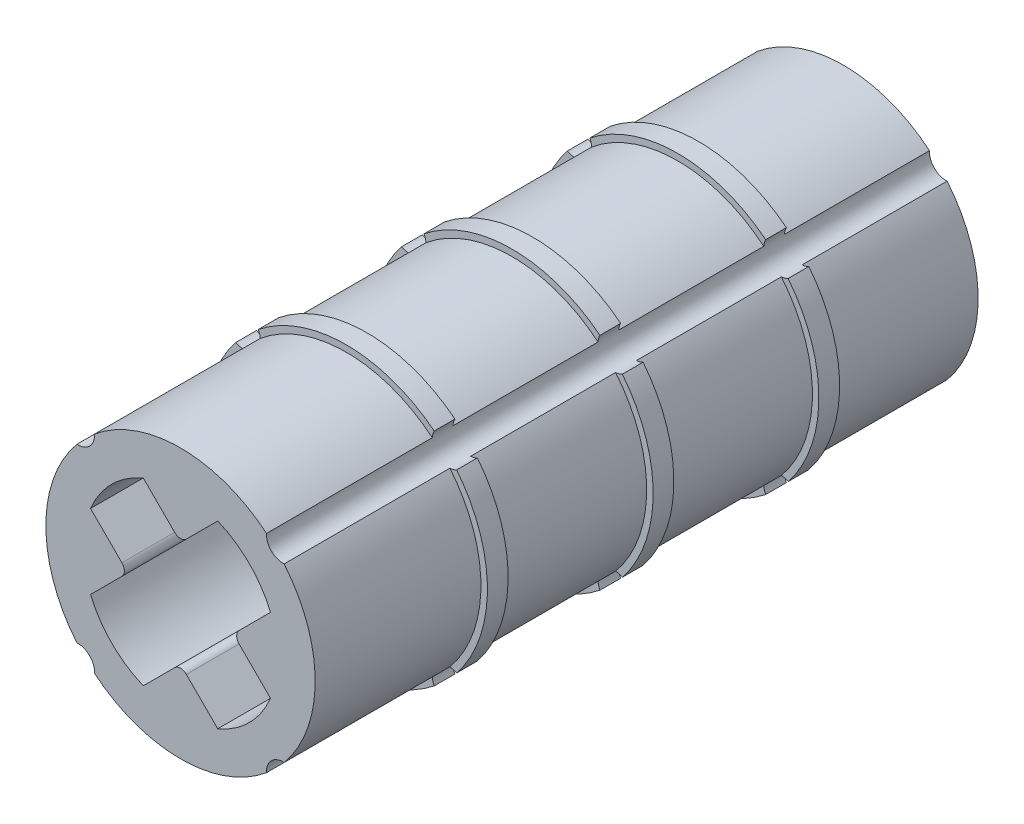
ISO-10303-21;
HEADER;
FILE_DESCRIPTION(('STEP AP214'),'2;1');
FILE_NAME('part.step','',(''),(''),'','','');
FILE_SCHEMA(('AUTOMOTIVE_DESIGN { 1 0 10303 214 1 1 1 1 }'));
ENDSEC;
DATA;
#1=APPLICATION_CONTEXT('core data for automotive mechanical design processes');
#2=APPLICATION_PROTOCOL_DEFINITION('international standard','automotive_design',2000,#1);
#3=PRODUCT_CONTEXT('',#1,'mechanical');
#4=PRODUCT('Part','Part','',(#3));
#5=PRODUCT_RELATED_PRODUCT_CATEGORY('part','',(#4));
#6=PRODUCT_DEFINITION_FORMATION('','',#4);
#7=PRODUCT_DEFINITION_CONTEXT('part definition',#1,'design');
#8=PRODUCT_DEFINITION('design','',#6,#7);
#9=PRODUCT_DEFINITION_SHAPE('','',#8);
#10=(LENGTH_UNIT() NAMED_UNIT(*) SI_UNIT(.MILLI.,.METRE.));
#11=(NAMED_UNIT(*) PLANE_ANGLE_UNIT() SI_UNIT($,.RADIAN.));
#12=(NAMED_UNIT(*) SI_UNIT($,.STERADIAN.) SOLID_ANGLE_UNIT());
#13=UNCERTAINTY_MEASURE_WITH_UNIT(LENGTH_MEASURE(1.E-05),#10,'distance_accuracy_value','');
#14=(GEOMETRIC_REPRESENTATION_CONTEXT(3) GLOBAL_UNCERTAINTY_ASSIGNED_CONTEXT((#13)) GLOBAL_UNIT_ASSIGNED_CONTEXT((#10,
#11,#12)) REPRESENTATION_CONTEXT('',''));
#15=CARTESIAN_POINT('',(0.,0.,0.));
#16=DIRECTION('',(0.,0.,1.));
#17=DIRECTION('',(1.,0.,0.));
#18=AXIS2_PLACEMENT_3D('',#15,#16,#17);
#19=CARTESIAN_POINT('',(0.,0.,-16.));
#20=DIRECTION('',(0.,0.,1.));
#21=DIRECTION('',(1.,0.,0.));
#22=AXIS2_PLACEMENT_3D('',#19,#20,#21);
#23=CYLINDRICAL_SURFACE('',#22,2.35);
#24=CARTESIAN_POINT('',(0.,0.,0.));
#25=DIRECTION('',(0.,0.,1.));
#26=DIRECTION('',(1.,0.,0.));
#27=AXIS2_PLACEMENT_3D('',#24,#25,#26);
#28=CIRCLE('',#27,2.35);
#29=CARTESIAN_POINT('',(-0.898612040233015,2.17140424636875,0.));
#30=VERTEX_POINT('',#29);
#31=CARTESIAN_POINT('',(-2.17140424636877,0.898612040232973,0.));
#32=VERTEX_POINT('',#31);
#33=EDGE_CURVE('E503',#30,#32,#28,.T.);
#34=ORIENTED_EDGE('',*,*,#33,.T.);
#35=DIRECTION('',(0.,0.,1.));
#36=VECTOR('',#35,1.);
#37=CARTESIAN_POINT('',(-2.17140424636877,0.898612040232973,-16.));
#38=LINE('',#37,#36);
#39=CARTESIAN_POINT('',(-2.17140424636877,0.898612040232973,-16.));
#40=VERTEX_POINT('',#39);
#41=EDGE_CURVE('E511',#32,#40,#38,.F.);
#42=ORIENTED_EDGE('',*,*,#41,.T.);
#43=CARTESIAN_POINT('',(0.,0.,-16.));
#44=DIRECTION('',(0.,0.,1.));
#45=DIRECTION('',(1.,0.,0.));
#46=AXIS2_PLACEMENT_3D('',#43,#44,#45);
#47=CIRCLE('',#46,2.35);
#48=CARTESIAN_POINT('',(-0.898612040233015,2.17140424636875,-16.));
#49=VERTEX_POINT('',#48);
#50=EDGE_CURVE('E785',#49,#40,#47,.T.);
#51=ORIENTED_EDGE('',*,*,#50,.F.);
#52=DIRECTION('',(0.,0.,1.));
#53=VECTOR('',#52,1.);
#54=CARTESIAN_POINT('',(-0.898612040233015,2.17140424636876,-16.));
#55=LINE('',#54,#53);
#56=EDGE_CURVE('E916',#49,#30,#55,.T.);
#57=ORIENTED_EDGE('',*,*,#56,.T.);
#58=EDGE_LOOP('',(#34,#42,#51,#57));
#59=FACE_BOUND('',#58,.T.);
#60=ADVANCED_FACE('F38',(#59),#23,.F.);
#61=CARTESIAN_POINT('',(0.989650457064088,2.26244266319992,-16.));
#62=DIRECTION('',(0.70710678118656,-0.707106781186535,0.));
#63=DIRECTION('',(0.707106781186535,0.70710678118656,0.));
#64=AXIS2_PLACEMENT_3D('',#61,#62,#63);
#65=PLANE('',#64);
#66=DIRECTION('',(0.707106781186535,0.70710678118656,0.));
#67=VECTOR('',#66,1.);
#68=CARTESIAN_POINT('',(0.989650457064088,2.26244266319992,0.));
#69=LINE('',#68,#67);
#70=CARTESIAN_POINT('',(0.141421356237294,1.4142135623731,0.));
#71=VERTEX_POINT('',#70);
#72=CARTESIAN_POINT('',(0.89861204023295,2.17140424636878,0.));
#73=VERTEX_POINT('',#72);
#74=EDGE_CURVE('E919',#71,#73,#69,.T.);
#75=ORIENTED_EDGE('',*,*,#74,.F.);
#76=DIRECTION('',(0.,0.,1.));
#77=VECTOR('',#76,1.);
#78=CARTESIAN_POINT('',(0.141421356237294,1.4142135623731,-16.));
#79=LINE('',#78,#77);
#80=CARTESIAN_POINT('',(0.141421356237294,1.4142135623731,-16.));
#81=VERTEX_POINT('',#80);
#82=EDGE_CURVE('E901',#71,#81,#79,.F.);
#83=ORIENTED_EDGE('',*,*,#82,.T.);
#84=DIRECTION('',(0.707106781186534,0.707106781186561,0.));
#85=VECTOR('',#84,1.);
#86=CARTESIAN_POINT('',(0.989650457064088,2.26244266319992,-16.));
#87=LINE('',#86,#85);
#88=CARTESIAN_POINT('',(0.89861204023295,2.17140424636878,-16.));
#89=VERTEX_POINT('',#88);
#90=EDGE_CURVE('E46',#81,#89,#87,.T.);
#91=ORIENTED_EDGE('',*,*,#90,.T.);
#92=DIRECTION('',(0.,0.,1.));
#93=VECTOR('',#92,1.);
#94=CARTESIAN_POINT('',(0.89861204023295,2.17140424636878,-16.));
#95=LINE('',#94,#93);
#96=EDGE_CURVE('E11',#73,#89,#95,.F.);
#97=ORIENTED_EDGE('',*,*,#96,.F.);
#98=EDGE_LOOP('',(#75,#83,#91,#97));
#99=FACE_BOUND('',#98,.T.);
#100=ADVANCED_FACE('F40',(#99),#65,.T.);
#101=CARTESIAN_POINT('',(0.,1.27279220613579,-16.));
#102=DIRECTION('',(-0.707106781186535,-0.70710678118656,0.));
#103=DIRECTION('',(0.70710678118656,-0.707106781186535,0.));
#104=AXIS2_PLACEMENT_3D('',#101,#102,#103);
#105=PLANE('',#104);
#106=DIRECTION('',(0.707106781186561,-0.707106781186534,0.));
#107=VECTOR('',#106,1.);
#108=CARTESIAN_POINT('',(-1.22194904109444,2.49474124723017,-16.));
#109=LINE('',#108,#107);
#110=CARTESIAN_POINT('',(-0.141421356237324,1.41421356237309,-16.));
#111=VERTEX_POINT('',#110);
#112=EDGE_CURVE('E910',#49,#111,#109,.T.);
#113=ORIENTED_EDGE('',*,*,#112,.T.);
#114=DIRECTION('',(0.,0.,1.));
#115=VECTOR('',#114,1.);
#116=CARTESIAN_POINT('',(-0.141421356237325,1.41421356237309,-16.));
#117=LINE('',#116,#115);
#118=CARTESIAN_POINT('',(-0.141421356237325,1.41421356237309,0.));
#119=VERTEX_POINT('',#118);
#120=EDGE_CURVE('E907',#111,#119,#117,.T.);
#121=ORIENTED_EDGE('',*,*,#120,.T.);
#122=DIRECTION('',(0.70710678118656,-0.707106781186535,0.));
#123=VECTOR('',#122,1.);
#124=CARTESIAN_POINT('',(0.,1.27279220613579,0.));
#125=LINE('',#124,#123);
#126=EDGE_CURVE('E913',#30,#119,#125,.T.);
#127=ORIENTED_EDGE('',*,*,#126,.F.);
#128=ORIENTED_EDGE('',*,*,#56,.F.);
#129=EDGE_LOOP('',(#113,#121,#127,#128));
#130=FACE_BOUND('',#129,.T.);
#131=ADVANCED_FACE('F949',(#130),#105,.T.);
#132=CARTESIAN_POINT('',(0.,1.5556349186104,-16.));
#133=DIRECTION('',(0.,0.,1.));
#134=DIRECTION('',(0.,-1.,0.));
#135=AXIS2_PLACEMENT_3D('',#132,#133,#134);
#136=CYLINDRICAL_SURFACE('',#135,0.2);
#137=CARTESIAN_POINT('',(0.,1.5556349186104,-16.));
#138=DIRECTION('',(0.,0.,1.));
#139=DIRECTION('',(0.,-1.,0.));
#140=AXIS2_PLACEMENT_3D('',#137,#138,#139);
#141=CIRCLE('',#140,0.2);
#142=EDGE_CURVE('E899',#81,#111,#141,.F.);
#143=ORIENTED_EDGE('',*,*,#142,.F.);
#144=ORIENTED_EDGE('',*,*,#82,.F.);
#145=CARTESIAN_POINT('',(0.,1.5556349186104,0.));
#146=DIRECTION('',(0.,0.,1.));
#147=DIRECTION('',(0.,-1.,0.));
#148=AXIS2_PLACEMENT_3D('',#145,#146,#147);
#149=CIRCLE('',#148,0.2);
#150=EDGE_CURVE('E904',#119,#71,#149,.T.);
#151=ORIENTED_EDGE('',*,*,#150,.F.);
#152=ORIENTED_EDGE('',*,*,#120,.F.);
#153=EDGE_LOOP('',(#143,#144,#151,#152));
#154=FACE_BOUND('',#153,.T.);
#155=ADVANCED_FACE('F954',(#154),#136,.T.);
#156=CARTESIAN_POINT('',(2.17140424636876,0.898612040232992,0.));
#157=VERTEX_POINT('',#156);
#158=EDGE_CURVE('E52',#157,#73,#28,.T.);
#159=ORIENTED_EDGE('',*,*,#158,.T.);
#160=ORIENTED_EDGE('',*,*,#96,.T.);
#161=CARTESIAN_POINT('',(2.17140424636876,0.898612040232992,-16.));
#162=VERTEX_POINT('',#161);
#163=EDGE_CURVE('E60',#162,#89,#47,.T.);
#164=ORIENTED_EDGE('',*,*,#163,.F.);
#165=DIRECTION('',(0.,0.,1.));
#166=VECTOR('',#165,1.);
#167=CARTESIAN_POINT('',(2.17140424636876,0.898612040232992,-16.));
#168=LINE('',#167,#166);
#169=EDGE_CURVE('E888',#162,#157,#168,.T.);
#170=ORIENTED_EDGE('',*,*,#169,.T.);
#171=EDGE_LOOP('',(#159,#160,#164,#170));
#172=FACE_BOUND('',#171,.T.);
#173=ADVANCED_FACE('F923',(#172),#23,.F.);
#174=CARTESIAN_POINT('',(2.26244266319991,-0.989650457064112,-16.));
#175=DIRECTION('',(-0.707106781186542,-0.707106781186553,0.));
#176=DIRECTION('',(0.707106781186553,-0.707106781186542,0.));
#177=AXIS2_PLACEMENT_3D('',#174,#175,#176);
#178=PLANE('',#177);
#179=DIRECTION('',(0.707106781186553,-0.707106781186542,0.));
#180=VECTOR('',#179,1.);
#181=CARTESIAN_POINT('',(2.26244266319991,-0.989650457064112,0.));
#182=LINE('',#181,#180);
#183=CARTESIAN_POINT('',(1.4142135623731,-0.141421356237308,0.));
#184=VERTEX_POINT('',#183);
#185=CARTESIAN_POINT('',(2.17140424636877,-0.898612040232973,0.));
#186=VERTEX_POINT('',#185);
#187=EDGE_CURVE('E890',#184,#186,#182,.T.);
#188=ORIENTED_EDGE('',*,*,#187,.F.);
#189=DIRECTION('',(0.,0.,1.));
#190=VECTOR('',#189,1.);
#191=CARTESIAN_POINT('',(1.4142135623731,-0.141421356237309,-16.));
#192=LINE('',#191,#190);
#193=CARTESIAN_POINT('',(1.4142135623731,-0.141421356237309,-16.));
#194=VERTEX_POINT('',#193);
#195=EDGE_CURVE('E873',#184,#194,#192,.F.);
#196=ORIENTED_EDGE('',*,*,#195,.T.);
#197=DIRECTION('',(0.707106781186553,-0.707106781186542,0.));
#198=VECTOR('',#197,1.);
#199=CARTESIAN_POINT('',(2.26244266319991,-0.989650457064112,-16.));
#200=LINE('',#199,#198);
#201=CARTESIAN_POINT('',(2.17140424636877,-0.898612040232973,-16.));
#202=VERTEX_POINT('',#201);
#203=EDGE_CURVE('E893',#194,#202,#200,.T.);
#204=ORIENTED_EDGE('',*,*,#203,.T.);
#205=DIRECTION('',(0.,0.,1.));
#206=VECTOR('',#205,1.);
#207=CARTESIAN_POINT('',(2.17140424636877,-0.898612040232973,-16.));
#208=LINE('',#207,#206);
#209=EDGE_CURVE('E896',#186,#202,#208,.F.);
#210=ORIENTED_EDGE('',*,*,#209,.F.);
#211=EDGE_LOOP('',(#188,#196,#204,#210));
#212=FACE_BOUND('',#211,.T.);
#213=ADVANCED_FACE('F953',(#212),#178,.T.);
#214=CARTESIAN_POINT('',(1.27279220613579,0.,-16.));
#215=DIRECTION('',(-0.707106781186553,0.707106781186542,0.));
#216=DIRECTION('',(-0.707106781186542,-0.707106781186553,0.));
#217=AXIS2_PLACEMENT_3D('',#214,#215,#216);
#218=PLANE('',#217);
#219=DIRECTION('',(-0.707106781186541,-0.707106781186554,0.));
#220=VECTOR('',#219,1.);
#221=CARTESIAN_POINT('',(2.49474124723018,1.22194904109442,-16.));
#222=LINE('',#221,#220);
#223=CARTESIAN_POINT('',(1.41421356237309,0.141421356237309,-16.));
#224=VERTEX_POINT('',#223);
#225=EDGE_CURVE('E882',#162,#224,#222,.T.);
#226=ORIENTED_EDGE('',*,*,#225,.T.);
#227=DIRECTION('',(0.,0.,1.));
#228=VECTOR('',#227,1.);
#229=CARTESIAN_POINT('',(1.41421356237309,0.141421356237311,-16.));
#230=LINE('',#229,#228);
#231=CARTESIAN_POINT('',(1.41421356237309,0.141421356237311,0.));
#232=VERTEX_POINT('',#231);
#233=EDGE_CURVE('E879',#224,#232,#230,.T.);
#234=ORIENTED_EDGE('',*,*,#233,.T.);
#235=DIRECTION('',(-0.707106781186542,-0.707106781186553,0.));
#236=VECTOR('',#235,1.);
#237=CARTESIAN_POINT('',(1.27279220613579,0.,0.));
#238=LINE('',#237,#236);
#239=EDGE_CURVE('E885',#157,#232,#238,.T.);
#240=ORIENTED_EDGE('',*,*,#239,.F.);
#241=ORIENTED_EDGE('',*,*,#169,.F.);
#242=EDGE_LOOP('',(#226,#234,#240,#241));
#243=FACE_BOUND('',#242,.T.);
#244=ADVANCED_FACE('F931',(#243),#218,.T.);
#245=CARTESIAN_POINT('',(1.5556349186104,0.,-16.));
#246=DIRECTION('',(0.,0.,1.));
#247=DIRECTION('',(-1.,0.,0.));
#248=AXIS2_PLACEMENT_3D('',#245,#246,#247);
#249=CYLINDRICAL_SURFACE('',#248,0.2);
#250=CARTESIAN_POINT('',(1.5556349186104,0.,-16.));
#251=DIRECTION('',(0.,0.,1.));
#252=DIRECTION('',(-1.,0.,0.));
#253=AXIS2_PLACEMENT_3D('',#250,#251,#252);
#254=CIRCLE('',#253,0.2);
#255=EDGE_CURVE('E871',#194,#224,#254,.F.);
#256=ORIENTED_EDGE('',*,*,#255,.F.);
#257=ORIENTED_EDGE('',*,*,#195,.F.);
#258=CARTESIAN_POINT('',(1.5556349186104,0.,0.));
#259=DIRECTION('',(0.,0.,1.));
#260=DIRECTION('',(-1.,0.,0.));
#261=AXIS2_PLACEMENT_3D('',#258,#259,#260);
#262=CIRCLE('',#261,0.2);
#263=EDGE_CURVE('E876',#232,#184,#262,.T.);
#264=ORIENTED_EDGE('',*,*,#263,.F.);
#265=ORIENTED_EDGE('',*,*,#233,.F.);
#266=EDGE_LOOP('',(#256,#257,#264,#265));
#267=FACE_BOUND('',#266,.T.);
#268=ADVANCED_FACE('F969',(#267),#249,.T.);
#269=CARTESIAN_POINT('',(0.898612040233,-2.17140424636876,0.));
#270=VERTEX_POINT('',#269);
#271=EDGE_CURVE('E504',#270,#186,#28,.T.);
#272=ORIENTED_EDGE('',*,*,#271,.T.);
#273=ORIENTED_EDGE('',*,*,#209,.T.);
#274=CARTESIAN_POINT('',(0.898612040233,-2.17140424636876,-16.));
#275=VERTEX_POINT('',#274);
#276=EDGE_CURVE('E786',#275,#202,#47,.T.);
#277=ORIENTED_EDGE('',*,*,#276,.F.);
#278=DIRECTION('',(0.,0.,1.));
#279=VECTOR('',#278,1.);
#280=CARTESIAN_POINT('',(0.898612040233,-2.17140424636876,-16.));
#281=LINE('',#280,#279);
#282=EDGE_CURVE('E862',#275,#270,#281,.T.);
#283=ORIENTED_EDGE('',*,*,#282,.T.);
#284=EDGE_LOOP('',(#272,#273,#277,#283));
#285=FACE_BOUND('',#284,.T.);
#286=ADVANCED_FACE('F955',(#285),#23,.F.);
#287=CARTESIAN_POINT('',(-0.989650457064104,-2.26244266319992,-16.));
#288=DIRECTION('',(-0.707106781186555,0.70710678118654,0.));
#289=DIRECTION('',(-0.70710678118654,-0.707106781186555,0.));
#290=AXIS2_PLACEMENT_3D('',#287,#288,#289);
#291=PLANE('',#290);
#292=DIRECTION('',(-0.70710678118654,-0.707106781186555,0.));
#293=VECTOR('',#292,1.);
#294=CARTESIAN_POINT('',(-0.989650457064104,-2.26244266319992,0.));
#295=LINE('',#294,#293);
#296=CARTESIAN_POINT('',(-0.141421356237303,-1.4142135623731,0.));
#297=VERTEX_POINT('',#296);
#298=CARTESIAN_POINT('',(-0.898612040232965,-2.17140424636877,0.));
#299=VERTEX_POINT('',#298);
#300=EDGE_CURVE('E496',#297,#299,#295,.T.);
#301=ORIENTED_EDGE('',*,*,#300,.F.);
#302=DIRECTION('',(0.,0.,1.));
#303=VECTOR('',#302,1.);
#304=CARTESIAN_POINT('',(-0.141421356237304,-1.4142135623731,-16.));
#305=LINE('',#304,#303);
#306=CARTESIAN_POINT('',(-0.141421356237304,-1.4142135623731,-16.));
#307=VERTEX_POINT('',#306);
#308=EDGE_CURVE('E848',#297,#307,#305,.F.);
#309=ORIENTED_EDGE('',*,*,#308,.T.);
#310=DIRECTION('',(-0.707106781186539,-0.707106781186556,0.));
#311=VECTOR('',#310,1.);
#312=CARTESIAN_POINT('',(-0.989650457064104,-2.26244266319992,-16.));
#313=LINE('',#312,#311);
#314=CARTESIAN_POINT('',(-0.898612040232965,-2.17140424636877,-16.));
#315=VERTEX_POINT('',#314);
#316=EDGE_CURVE('E866',#307,#315,#313,.T.);
#317=ORIENTED_EDGE('',*,*,#316,.T.);
#318=DIRECTION('',(0.,0.,1.));
#319=VECTOR('',#318,1.);
#320=CARTESIAN_POINT('',(-0.898612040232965,-2.17140424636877,-16.));
#321=LINE('',#320,#319);
#322=EDGE_CURVE('E869',#299,#315,#321,.F.);
#323=ORIENTED_EDGE('',*,*,#322,.F.);
#324=EDGE_LOOP('',(#301,#309,#317,#323));
#325=FACE_BOUND('',#324,.T.);
#326=ADVANCED_FACE('F968',(#325),#291,.T.);
#327=CARTESIAN_POINT('',(0.,-1.27279220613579,-16.));
#328=DIRECTION('',(0.70710678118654,0.707106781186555,0.));
#329=DIRECTION('',(-0.707106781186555,0.70710678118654,0.));
#330=AXIS2_PLACEMENT_3D('',#327,#328,#329);
#331=PLANE('',#330);
#332=DIRECTION('',(-0.707106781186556,0.707106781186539,0.));
#333=VECTOR('',#332,1.);
#334=CARTESIAN_POINT('',(1.22194904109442,-2.49474124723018,-16.));
#335=LINE('',#334,#333);
#336=CARTESIAN_POINT('',(0.141421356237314,-1.41421356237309,-16.));
#337=VERTEX_POINT('',#336);
#338=EDGE_CURVE('E856',#275,#337,#335,.T.);
#339=ORIENTED_EDGE('',*,*,#338,.T.);
#340=DIRECTION('',(0.,0.,1.));
#341=VECTOR('',#340,1.);
#342=CARTESIAN_POINT('',(0.141421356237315,-1.41421356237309,-16.));
#343=LINE('',#342,#341);
#344=CARTESIAN_POINT('',(0.141421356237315,-1.41421356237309,0.));
#345=VERTEX_POINT('',#344);
#346=EDGE_CURVE('E853',#337,#345,#343,.T.);
#347=ORIENTED_EDGE('',*,*,#346,.T.);
#348=DIRECTION('',(-0.707106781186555,0.70710678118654,0.));
#349=VECTOR('',#348,1.);
#350=CARTESIAN_POINT('',(0.,-1.27279220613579,0.));
#351=LINE('',#350,#349);
#352=EDGE_CURVE('E859',#270,#345,#351,.T.);
#353=ORIENTED_EDGE('',*,*,#352,.F.);
#354=ORIENTED_EDGE('',*,*,#282,.F.);
#355=EDGE_LOOP('',(#339,#347,#353,#354));
#356=FACE_BOUND('',#355,.T.);
#357=ADVANCED_FACE('F975',(#356),#331,.T.);
#358=CARTESIAN_POINT('',(0.,-1.5556349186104,-16.));
#359=DIRECTION('',(0.,0.,1.));
#360=DIRECTION('',(0.,1.,0.));
#361=AXIS2_PLACEMENT_3D('',#358,#359,#360);
#362=CYLINDRICAL_SURFACE('',#361,0.2);
#363=CARTESIAN_POINT('',(0.,-1.5556349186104,-16.));
#364=DIRECTION('',(0.,0.,1.));
#365=DIRECTION('',(0.,1.,0.));
#366=AXIS2_PLACEMENT_3D('',#363,#364,#365);
#367=CIRCLE('',#366,0.2);
#368=EDGE_CURVE('E846',#307,#337,#367,.F.);
#369=ORIENTED_EDGE('',*,*,#368,.F.);
#370=ORIENTED_EDGE('',*,*,#308,.F.);
#371=CARTESIAN_POINT('',(0.,-1.5556349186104,0.));
#372=DIRECTION('',(0.,0.,1.));
#373=DIRECTION('',(0.,1.,0.));
#374=AXIS2_PLACEMENT_3D('',#371,#372,#373);
#375=CIRCLE('',#374,0.2);
#376=EDGE_CURVE('E851',#345,#297,#375,.T.);
#377=ORIENTED_EDGE('',*,*,#376,.F.);
#378=ORIENTED_EDGE('',*,*,#346,.F.);
#379=EDGE_LOOP('',(#369,#370,#377,#378));
#380=FACE_BOUND('',#379,.T.);
#381=ADVANCED_FACE('F1007',(#380),#362,.T.);
#382=CARTESIAN_POINT('',(0.,0.,-16.));
#383=DIRECTION('',(0.,0.,1.));
#384=DIRECTION('',(1.,0.,0.));
#385=AXIS2_PLACEMENT_3D('',#382,#383,#384);
#386=CYLINDRICAL_SURFACE('',#385,3.25);
#387=DIRECTION('',(0.,0.,1.));
#388=VECTOR('',#387,1.);
#389=CARTESIAN_POINT('',(2.50078241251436,-2.07571369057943,-10.));
#390=LINE('',#389,#388);
#391=CARTESIAN_POINT('',(2.50078241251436,-2.07571369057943,-16.));
#392=VERTEX_POINT('',#391);
#393=CARTESIAN_POINT('',(2.50078241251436,-2.07571369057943,-12.5));
#394=VERTEX_POINT('',#393);
#395=EDGE_CURVE('E553',#392,#394,#390,.T.);
#396=ORIENTED_EDGE('',*,*,#395,.F.);
#397=CARTESIAN_POINT('',(0.,0.,-16.));
#398=DIRECTION('',(0.,0.,1.));
#399=DIRECTION('',(1.,0.,0.));
#400=AXIS2_PLACEMENT_3D('',#397,#398,#399);
#401=CIRCLE('',#400,3.25);
#402=CARTESIAN_POINT('',(2.50078241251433,2.07571369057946,-16.));
#403=VERTEX_POINT('',#402);
#404=EDGE_CURVE('E793',#392,#403,#401,.T.);
#405=ORIENTED_EDGE('',*,*,#404,.T.);
#406=DIRECTION('',(0.,0.,1.));
#407=VECTOR('',#406,1.);
#408=CARTESIAN_POINT('',(2.50078241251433,2.07571369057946,-10.));
#409=LINE('',#408,#407);
#410=CARTESIAN_POINT('',(2.50078241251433,2.07571369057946,-12.5));
#411=VERTEX_POINT('',#410);
#412=EDGE_CURVE('E709',#411,#403,#409,.F.);
#413=ORIENTED_EDGE('',*,*,#412,.F.);
#414=CARTESIAN_POINT('',(0.,0.,-12.5));
#415=DIRECTION('',(0.,0.,1.));
#416=DIRECTION('',(1.,0.,0.));
#417=AXIS2_PLACEMENT_3D('',#414,#415,#416);
#418=CIRCLE('',#417,3.25);
#419=EDGE_CURVE('E820',#411,#394,#418,.F.);
#420=ORIENTED_EDGE('',*,*,#419,.T.);
#421=EDGE_LOOP('',(#396,#405,#413,#420));
#422=FACE_BOUND('',#421,.T.);
#423=ADVANCED_FACE('F1010',(#422),#386,.T.);
#424=DIRECTION('',(0.,0.,1.));
#425=VECTOR('',#424,1.);
#426=CARTESIAN_POINT('',(2.50078241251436,-2.07571369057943,-10.));
#427=LINE('',#426,#425);
#428=CARTESIAN_POINT('',(2.50078241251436,-2.07571369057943,-12.));
#429=VERTEX_POINT('',#428);
#430=CARTESIAN_POINT('',(2.50078241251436,-2.07571369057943,-8.5));
#431=VERTEX_POINT('',#430);
#432=EDGE_CURVE('E568',#429,#431,#427,.T.);
#433=ORIENTED_EDGE('',*,*,#432,.F.);
#434=CARTESIAN_POINT('',(0.,0.,-12.));
#435=DIRECTION('',(0.,0.,1.));
#436=DIRECTION('',(1.,0.,0.));
#437=AXIS2_PLACEMENT_3D('',#434,#435,#436);
#438=CIRCLE('',#437,3.25);
#439=CARTESIAN_POINT('',(2.50078241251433,2.07571369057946,-12.));
#440=VERTEX_POINT('',#439);
#441=EDGE_CURVE('E815',#440,#429,#438,.F.);
#442=ORIENTED_EDGE('',*,*,#441,.F.);
#443=DIRECTION('',(0.,0.,1.));
#444=VECTOR('',#443,1.);
#445=CARTESIAN_POINT('',(2.50078241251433,2.07571369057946,-10.));
#446=LINE('',#445,#444);
#447=CARTESIAN_POINT('',(2.50078241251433,2.07571369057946,-8.5));
#448=VERTEX_POINT('',#447);
#449=EDGE_CURVE('E696',#448,#440,#446,.F.);
#450=ORIENTED_EDGE('',*,*,#449,.F.);
#451=CARTESIAN_POINT('',(0.,0.,-8.5));
#452=DIRECTION('',(0.,0.,1.));
#453=DIRECTION('',(1.,0.,0.));
#454=AXIS2_PLACEMENT_3D('',#451,#452,#453);
#455=CIRCLE('',#454,3.25);
#456=EDGE_CURVE('E811',#448,#431,#455,.F.);
#457=ORIENTED_EDGE('',*,*,#456,.T.);
#458=EDGE_LOOP('',(#433,#442,#450,#457));
#459=FACE_BOUND('',#458,.T.);
#460=ADVANCED_FACE('F1131',(#459),#386,.T.);
#461=DIRECTION('',(0.,0.,1.));
#462=VECTOR('',#461,1.);
#463=CARTESIAN_POINT('',(2.50078241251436,-2.07571369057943,-10.));
#464=LINE('',#463,#462);
#465=CARTESIAN_POINT('',(2.50078241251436,-2.07571369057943,-8.));
#466=VERTEX_POINT('',#465);
#467=CARTESIAN_POINT('',(2.50078241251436,-2.07571369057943,-4.5));
#468=VERTEX_POINT('',#467);
#469=EDGE_CURVE('E572',#466,#468,#464,.T.);
#470=ORIENTED_EDGE('',*,*,#469,.F.);
#471=CARTESIAN_POINT('',(0.,0.,-8.));
#472=DIRECTION('',(0.,0.,1.));
#473=DIRECTION('',(1.,0.,0.));
#474=AXIS2_PLACEMENT_3D('',#471,#472,#473);
#475=CIRCLE('',#474,3.25);
#476=CARTESIAN_POINT('',(2.50078241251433,2.07571369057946,-8.));
#477=VERTEX_POINT('',#476);
#478=EDGE_CURVE('E806',#477,#466,#475,.F.);
#479=ORIENTED_EDGE('',*,*,#478,.F.);
#480=DIRECTION('',(0.,0.,1.));
#481=VECTOR('',#480,1.);
#482=CARTESIAN_POINT('',(2.50078241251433,2.07571369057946,-10.));
#483=LINE('',#482,#481);
#484=CARTESIAN_POINT('',(2.50078241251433,2.07571369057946,-4.5));
#485=VERTEX_POINT('',#484);
#486=EDGE_CURVE('E719',#485,#477,#483,.F.);
#487=ORIENTED_EDGE('',*,*,#486,.F.);
#488=CARTESIAN_POINT('',(0.,0.,-4.5));
#489=DIRECTION('',(0.,0.,1.));
#490=DIRECTION('',(1.,0.,0.));
#491=AXIS2_PLACEMENT_3D('',#488,#489,#490);
#492=CIRCLE('',#491,3.25);
#493=EDGE_CURVE('E501',#485,#468,#492,.F.);
#494=ORIENTED_EDGE('',*,*,#493,.T.);
#495=EDGE_LOOP('',(#470,#479,#487,#494));
#496=FACE_BOUND('',#495,.T.);
#497=ADVANCED_FACE('F1127',(#496),#386,.T.);
#498=DIRECTION('',(0.,0.,1.));
#499=VECTOR('',#498,1.);
#500=CARTESIAN_POINT('',(2.50078241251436,-2.07571369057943,-10.));
#501=LINE('',#500,#499);
#502=CARTESIAN_POINT('',(2.50078241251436,-2.07571369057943,-4.));
#503=VERTEX_POINT('',#502);
#504=CARTESIAN_POINT('',(2.50078241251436,-2.07571369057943,0.));
#505=VERTEX_POINT('',#504);
#506=EDGE_CURVE('E576',#503,#505,#501,.T.);
#507=ORIENTED_EDGE('',*,*,#506,.F.);
#508=CARTESIAN_POINT('',(0.,0.,-4.));
#509=DIRECTION('',(0.,0.,1.));
#510=DIRECTION('',(1.,0.,0.));
#511=AXIS2_PLACEMENT_3D('',#508,#509,#510);
#512=CIRCLE('',#511,3.25);
#513=CARTESIAN_POINT('',(2.50078241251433,2.07571369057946,-4.));
#514=VERTEX_POINT('',#513);
#515=EDGE_CURVE('E798',#514,#503,#512,.F.);
#516=ORIENTED_EDGE('',*,*,#515,.F.);
#517=DIRECTION('',(0.,0.,1.));
#518=VECTOR('',#517,1.);
#519=CARTESIAN_POINT('',(2.50078241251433,2.07571369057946,-10.));
#520=LINE('',#519,#518);
#521=CARTESIAN_POINT('',(2.50078241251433,2.07571369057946,0.));
#522=VERTEX_POINT('',#521);
#523=EDGE_CURVE('E736',#522,#514,#520,.F.);
#524=ORIENTED_EDGE('',*,*,#523,.F.);
#525=CARTESIAN_POINT('',(0.,0.,0.));
#526=DIRECTION('',(0.,0.,1.));
#527=DIRECTION('',(1.,0.,0.));
#528=AXIS2_PLACEMENT_3D('',#525,#526,#527);
#529=CIRCLE('',#528,3.25);
#530=EDGE_CURVE('E784',#505,#522,#529,.T.);
#531=ORIENTED_EDGE('',*,*,#530,.F.);
#532=EDGE_LOOP('',(#507,#516,#524,#531));
#533=FACE_BOUND('',#532,.T.);
#534=ADVANCED_FACE('F1108',(#533),#386,.T.);
#535=CARTESIAN_POINT('',(0.,0.,-4.5));
#536=DIRECTION('',(0.,0.,1.));
#537=DIRECTION('',(1.,0.,0.));
#538=AXIS2_PLACEMENT_3D('',#535,#536,#537);
#539=CYLINDRICAL_SURFACE('',#538,3.40636746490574);
#540=DIRECTION('',(0.,0.,1.));
#541=VECTOR('',#540,1.);
#542=CARTESIAN_POINT('',(2.66423956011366,-2.1225378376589,-10.));
#543=LINE('',#542,#541);
#544=CARTESIAN_POINT('',(2.66423956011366,-2.12253783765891,-4.5));
#545=VERTEX_POINT('',#544);
#546=CARTESIAN_POINT('',(2.66423956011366,-2.1225378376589,-4.));
#547=VERTEX_POINT('',#546);
#548=EDGE_CURVE('E574',#545,#547,#543,.T.);
#549=ORIENTED_EDGE('',*,*,#548,.F.);
#550=CARTESIAN_POINT('',(0.,0.,-4.5));
#551=DIRECTION('',(0.,0.,1.));
#552=DIRECTION('',(1.,0.,0.));
#553=AXIS2_PLACEMENT_3D('',#550,#551,#552);
#554=CIRCLE('',#553,3.40636746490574);
#555=CARTESIAN_POINT('',(2.66423956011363,2.12253783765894,-4.5));
#556=VERTEX_POINT('',#555);
#557=EDGE_CURVE('E778',#545,#556,#554,.T.);
#558=ORIENTED_EDGE('',*,*,#557,.T.);
#559=DIRECTION('',(0.,0.,1.));
#560=VECTOR('',#559,1.);
#561=CARTESIAN_POINT('',(2.66423956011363,2.12253783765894,-10.));
#562=LINE('',#561,#560);
#563=CARTESIAN_POINT('',(2.66423956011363,2.12253783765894,-4.));
#564=VERTEX_POINT('',#563);
#565=EDGE_CURVE('E729',#564,#556,#562,.F.);
#566=ORIENTED_EDGE('',*,*,#565,.F.);
#567=CARTESIAN_POINT('',(0.,0.,-4.));
#568=DIRECTION('',(0.,0.,1.));
#569=DIRECTION('',(1.,0.,0.));
#570=AXIS2_PLACEMENT_3D('',#567,#568,#569);
#571=CIRCLE('',#570,3.40636746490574);
#572=EDGE_CURVE('E783',#547,#564,#571,.T.);
#573=ORIENTED_EDGE('',*,*,#572,.F.);
#574=EDGE_LOOP('',(#549,#558,#566,#573));
#575=FACE_BOUND('',#574,.T.);
#576=ADVANCED_FACE('F964',(#575),#539,.T.);
#577=CARTESIAN_POINT('',(0.,0.,-8.5));
#578=DIRECTION('',(0.,0.,1.));
#579=DIRECTION('',(1.,0.,0.));
#580=AXIS2_PLACEMENT_3D('',#577,#578,#579);
#581=CYLINDRICAL_SURFACE('',#580,3.40636746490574);
#582=DIRECTION('',(0.,0.,1.));
#583=VECTOR('',#582,1.);
#584=CARTESIAN_POINT('',(2.66423956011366,-2.1225378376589,-10.));
#585=LINE('',#584,#583);
#586=CARTESIAN_POINT('',(2.66423956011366,-2.12253783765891,-8.5));
#587=VERTEX_POINT('',#586);
#588=CARTESIAN_POINT('',(2.66423956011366,-2.1225378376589,-8.));
#589=VERTEX_POINT('',#588);
#590=EDGE_CURVE('E570',#587,#589,#585,.T.);
#591=ORIENTED_EDGE('',*,*,#590,.F.);
#592=CARTESIAN_POINT('',(0.,0.,-8.5));
#593=DIRECTION('',(0.,0.,1.));
#594=DIRECTION('',(1.,0.,0.));
#595=AXIS2_PLACEMENT_3D('',#592,#593,#594);
#596=CIRCLE('',#595,3.40636746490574);
#597=CARTESIAN_POINT('',(2.66423956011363,2.12253783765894,-8.5));
#598=VERTEX_POINT('',#597);
#599=EDGE_CURVE('E767',#587,#598,#596,.T.);
#600=ORIENTED_EDGE('',*,*,#599,.T.);
#601=DIRECTION('',(0.,0.,1.));
#602=VECTOR('',#601,1.);
#603=CARTESIAN_POINT('',(2.66423956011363,2.12253783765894,-10.));
#604=LINE('',#603,#602);
#605=CARTESIAN_POINT('',(2.66423956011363,2.12253783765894,-8.));
#606=VERTEX_POINT('',#605);
#607=EDGE_CURVE('E705',#606,#598,#604,.F.);
#608=ORIENTED_EDGE('',*,*,#607,.F.);
#609=CARTESIAN_POINT('',(0.,0.,-8.));
#610=DIRECTION('',(0.,0.,1.));
#611=DIRECTION('',(1.,0.,0.));
#612=AXIS2_PLACEMENT_3D('',#609,#610,#611);
#613=CIRCLE('',#612,3.40636746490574);
#614=EDGE_CURVE('E772',#589,#606,#613,.T.);
#615=ORIENTED_EDGE('',*,*,#614,.F.);
#616=EDGE_LOOP('',(#591,#600,#608,#615));
#617=FACE_BOUND('',#616,.T.);
#618=ADVANCED_FACE('F1210',(#617),#581,.T.);
#619=CARTESIAN_POINT('',(0.,0.,-12.5));
#620=DIRECTION('',(0.,0.,1.));
#621=DIRECTION('',(1.,0.,0.));
#622=AXIS2_PLACEMENT_3D('',#619,#620,#621);
#623=CYLINDRICAL_SURFACE('',#622,3.40636746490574);
#624=DIRECTION('',(0.,0.,1.));
#625=VECTOR('',#624,1.);
#626=CARTESIAN_POINT('',(2.66423956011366,-2.1225378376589,-10.));
#627=LINE('',#626,#625);
#628=CARTESIAN_POINT('',(2.66423956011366,-2.12253783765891,-12.5));
#629=VERTEX_POINT('',#628);
#630=CARTESIAN_POINT('',(2.66423956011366,-2.1225378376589,-12.));
#631=VERTEX_POINT('',#630);
#632=EDGE_CURVE('E558',#629,#631,#627,.T.);
#633=ORIENTED_EDGE('',*,*,#632,.F.);
#634=CARTESIAN_POINT('',(0.,0.,-12.5));
#635=DIRECTION('',(0.,0.,1.));
#636=DIRECTION('',(1.,0.,0.));
#637=AXIS2_PLACEMENT_3D('',#634,#635,#636);
#638=CIRCLE('',#637,3.40636746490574);
#639=CARTESIAN_POINT('',(2.66423956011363,2.12253783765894,-12.5));
#640=VERTEX_POINT('',#639);
#641=EDGE_CURVE('E757',#629,#640,#638,.T.);
#642=ORIENTED_EDGE('',*,*,#641,.T.);
#643=DIRECTION('',(0.,0.,1.));
#644=VECTOR('',#643,1.);
#645=CARTESIAN_POINT('',(2.66423956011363,2.12253783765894,-10.));
#646=LINE('',#645,#644);
#647=CARTESIAN_POINT('',(2.66423956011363,2.12253783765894,-12.));
#648=VERTEX_POINT('',#647);
#649=EDGE_CURVE('E693',#648,#640,#646,.F.);
#650=ORIENTED_EDGE('',*,*,#649,.F.);
#651=CARTESIAN_POINT('',(0.,0.,-12.));
#652=DIRECTION('',(0.,0.,1.));
#653=DIRECTION('',(1.,0.,0.));
#654=AXIS2_PLACEMENT_3D('',#651,#652,#653);
#655=CIRCLE('',#654,3.40636746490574);
#656=EDGE_CURVE('E751',#631,#648,#655,.T.);
#657=ORIENTED_EDGE('',*,*,#656,.F.);
#658=EDGE_LOOP('',(#633,#642,#650,#657));
#659=FACE_BOUND('',#658,.T.);
#660=ADVANCED_FACE('F1218',(#659),#623,.T.);
#661=CARTESIAN_POINT('',(0.,0.,-4.5));
#662=DIRECTION('',(0.,0.,1.));
#663=DIRECTION('',(1.,0.,0.));
#664=AXIS2_PLACEMENT_3D('',#661,#662,#663);
#665=PLANE('',#664);
#666=ORIENTED_EDGE('',*,*,#557,.F.);
#667=CARTESIAN_POINT('',(2.47487373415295,-2.47487373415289,-4.5));
#668=DIRECTION('',(0.,0.,1.));
#669=DIRECTION('',(1.,0.,0.));
#670=AXIS2_PLACEMENT_3D('',#667,#668,#669);
#671=CIRCLE('',#670,0.4);
#672=EDGE_CURVE('E559',#545,#468,#671,.T.);
#673=ORIENTED_EDGE('',*,*,#672,.T.);
#674=ORIENTED_EDGE('',*,*,#493,.F.);
#675=CARTESIAN_POINT('',(2.47487373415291,2.47487373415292,-4.5));
#676=DIRECTION('',(0.,0.,1.));
#677=DIRECTION('',(1.,0.,0.));
#678=AXIS2_PLACEMENT_3D('',#675,#676,#677);
#679=CIRCLE('',#678,0.4);
#680=EDGE_CURVE('E726',#485,#556,#679,.T.);
#681=ORIENTED_EDGE('',*,*,#680,.T.);
#682=EDGE_LOOP('',(#666,#673,#674,#681));
#683=FACE_BOUND('',#682,.T.);
#684=ADVANCED_FACE('F1229',(#683),#665,.F.);
#685=CARTESIAN_POINT('',(0.,0.,-4.));
#686=DIRECTION('',(0.,0.,1.));
#687=DIRECTION('',(1.,0.,0.));
#688=AXIS2_PLACEMENT_3D('',#685,#686,#687);
#689=PLANE('',#688);
#690=CARTESIAN_POINT('',(2.47487373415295,-2.47487373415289,-4.));
#691=DIRECTION('',(0.,0.,1.));
#692=DIRECTION('',(1.,0.,0.));
#693=AXIS2_PLACEMENT_3D('',#690,#691,#692);
#694=CIRCLE('',#693,0.4);
#695=EDGE_CURVE('E566',#547,#503,#694,.T.);
#696=ORIENTED_EDGE('',*,*,#695,.F.);
#697=ORIENTED_EDGE('',*,*,#572,.T.);
#698=CARTESIAN_POINT('',(2.47487373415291,2.47487373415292,-4.));
#699=DIRECTION('',(0.,0.,1.));
#700=DIRECTION('',(1.,0.,0.));
#701=AXIS2_PLACEMENT_3D('',#698,#699,#700);
#702=CIRCLE('',#701,0.4);
#703=EDGE_CURVE('E733',#514,#564,#702,.T.);
#704=ORIENTED_EDGE('',*,*,#703,.F.);
#705=ORIENTED_EDGE('',*,*,#515,.T.);
#706=EDGE_LOOP('',(#696,#697,#704,#705));
#707=FACE_BOUND('',#706,.T.);
#708=ADVANCED_FACE('F1239',(#707),#689,.T.);
#709=CARTESIAN_POINT('',(0.,0.,-8.5));
#710=DIRECTION('',(0.,0.,1.));
#711=DIRECTION('',(1.,0.,0.));
#712=AXIS2_PLACEMENT_3D('',#709,#710,#711);
#713=PLANE('',#712);
#714=ORIENTED_EDGE('',*,*,#599,.F.);
#715=CARTESIAN_POINT('',(2.47487373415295,-2.47487373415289,-8.5));
#716=DIRECTION('',(0.,0.,1.));
#717=DIRECTION('',(1.,0.,0.));
#718=AXIS2_PLACEMENT_3D('',#715,#716,#717);
#719=CIRCLE('',#718,0.4);
#720=EDGE_CURVE('E541',#587,#431,#719,.T.);
#721=ORIENTED_EDGE('',*,*,#720,.T.);
#722=ORIENTED_EDGE('',*,*,#456,.F.);
#723=CARTESIAN_POINT('',(2.47487373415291,2.47487373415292,-8.5));
#724=DIRECTION('',(0.,0.,1.));
#725=DIRECTION('',(1.,0.,0.));
#726=AXIS2_PLACEMENT_3D('',#723,#724,#725);
#727=CIRCLE('',#726,0.4);
#728=EDGE_CURVE('E701',#448,#598,#727,.T.);
#729=ORIENTED_EDGE('',*,*,#728,.T.);
#730=EDGE_LOOP('',(#714,#721,#722,#729));
#731=FACE_BOUND('',#730,.T.);
#732=ADVANCED_FACE('F1250',(#731),#713,.F.);
#733=CARTESIAN_POINT('',(0.,0.,-8.));
#734=DIRECTION('',(0.,0.,1.));
#735=DIRECTION('',(1.,0.,0.));
#736=AXIS2_PLACEMENT_3D('',#733,#734,#735);
#737=PLANE('',#736);
#738=CARTESIAN_POINT('',(2.47487373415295,-2.47487373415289,-8.));
#739=DIRECTION('',(0.,0.,1.));
#740=DIRECTION('',(1.,0.,0.));
#741=AXIS2_PLACEMENT_3D('',#738,#739,#740);
#742=CIRCLE('',#741,0.4);
#743=EDGE_CURVE('E548',#589,#466,#742,.T.);
#744=ORIENTED_EDGE('',*,*,#743,.F.);
#745=ORIENTED_EDGE('',*,*,#614,.T.);
#746=CARTESIAN_POINT('',(2.47487373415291,2.47487373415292,-8.));
#747=DIRECTION('',(0.,0.,1.));
#748=DIRECTION('',(1.,0.,0.));
#749=AXIS2_PLACEMENT_3D('',#746,#747,#748);
#750=CIRCLE('',#749,0.4);
#751=EDGE_CURVE('E712',#477,#606,#750,.T.);
#752=ORIENTED_EDGE('',*,*,#751,.F.);
#753=ORIENTED_EDGE('',*,*,#478,.T.);
#754=EDGE_LOOP('',(#744,#745,#752,#753));
#755=FACE_BOUND('',#754,.T.);
#756=ADVANCED_FACE('F1262',(#755),#737,.T.);
#757=CARTESIAN_POINT('',(0.,0.,-12.5));
#758=DIRECTION('',(0.,0.,1.));
#759=DIRECTION('',(1.,0.,0.));
#760=AXIS2_PLACEMENT_3D('',#757,#758,#759);
#761=PLANE('',#760);
#762=ORIENTED_EDGE('',*,*,#641,.F.);
#763=CARTESIAN_POINT('',(2.47487373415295,-2.47487373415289,-12.5));
#764=DIRECTION('',(0.,0.,1.));
#765=DIRECTION('',(1.,0.,0.));
#766=AXIS2_PLACEMENT_3D('',#763,#764,#765);
#767=CIRCLE('',#766,0.4);
#768=EDGE_CURVE('E537',#629,#394,#767,.T.);
#769=ORIENTED_EDGE('',*,*,#768,.T.);
#770=ORIENTED_EDGE('',*,*,#419,.F.);
#771=CARTESIAN_POINT('',(2.47487373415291,2.47487373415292,-12.5));
#772=DIRECTION('',(0.,0.,1.));
#773=DIRECTION('',(1.,0.,0.));
#774=AXIS2_PLACEMENT_3D('',#771,#772,#773);
#775=CIRCLE('',#774,0.4);
#776=EDGE_CURVE('E698',#411,#640,#775,.T.);
#777=ORIENTED_EDGE('',*,*,#776,.T.);
#778=EDGE_LOOP('',(#762,#769,#770,#777));
#779=FACE_BOUND('',#778,.T.);
#780=ADVANCED_FACE('F1273',(#779),#761,.F.);
#781=CARTESIAN_POINT('',(0.,0.,-12.));
#782=DIRECTION('',(0.,0.,1.));
#783=DIRECTION('',(1.,0.,0.));
#784=AXIS2_PLACEMENT_3D('',#781,#782,#783);
#785=PLANE('',#784);
#786=CARTESIAN_POINT('',(2.47487373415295,-2.47487373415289,-12.));
#787=DIRECTION('',(0.,0.,1.));
#788=DIRECTION('',(1.,0.,0.));
#789=AXIS2_PLACEMENT_3D('',#786,#787,#788);
#790=CIRCLE('',#789,0.4);
#791=EDGE_CURVE('E512',#631,#429,#790,.T.);
#792=ORIENTED_EDGE('',*,*,#791,.F.);
#793=ORIENTED_EDGE('',*,*,#656,.T.);
#794=CARTESIAN_POINT('',(2.47487373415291,2.47487373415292,-12.));
#795=DIRECTION('',(0.,0.,1.));
#796=DIRECTION('',(1.,0.,0.));
#797=AXIS2_PLACEMENT_3D('',#794,#795,#796);
#798=CIRCLE('',#797,0.4);
#799=EDGE_CURVE('E818',#440,#648,#798,.T.);
#800=ORIENTED_EDGE('',*,*,#799,.F.);
#801=ORIENTED_EDGE('',*,*,#441,.T.);
#802=EDGE_LOOP('',(#792,#793,#800,#801));
#803=FACE_BOUND('',#802,.T.);
#804=ADVANCED_FACE('F1106',(#803),#785,.T.);
#805=DIRECTION('',(0.,0.,1.));
#806=VECTOR('',#805,1.);
#807=CARTESIAN_POINT('',(2.07571369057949,-2.50078241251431,-10.));
#808=LINE('',#807,#806);
#809=CARTESIAN_POINT('',(2.07571369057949,-2.50078241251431,-12.5));
#810=VERTEX_POINT('',#809);
#811=CARTESIAN_POINT('',(2.07571369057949,-2.50078241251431,-16.));
#812=VERTEX_POINT('',#811);
#813=EDGE_CURVE('E543',#810,#812,#808,.F.);
#814=ORIENTED_EDGE('',*,*,#813,.F.);
#815=CARTESIAN_POINT('',(-2.07571369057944,-2.50078241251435,-12.5));
#816=VERTEX_POINT('',#815);
#817=EDGE_CURVE('E823',#810,#816,#418,.F.);
#818=ORIENTED_EDGE('',*,*,#817,.T.);
#819=DIRECTION('',(0.,0.,1.));
#820=VECTOR('',#819,1.);
#821=CARTESIAN_POINT('',(-2.07571369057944,-2.50078241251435,-10.));
#822=LINE('',#821,#820);
#823=CARTESIAN_POINT('',(-2.07571369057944,-2.50078241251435,-16.));
#824=VERTEX_POINT('',#823);
#825=EDGE_CURVE('E595',#824,#816,#822,.T.);
#826=ORIENTED_EDGE('',*,*,#825,.F.);
#827=EDGE_CURVE('E1923',#824,#812,#401,.T.);
#828=ORIENTED_EDGE('',*,*,#827,.T.);
#829=EDGE_LOOP('',(#814,#818,#826,#828));
#830=FACE_BOUND('',#829,.T.);
#831=ADVANCED_FACE('F1102',(#830),#386,.T.);
#832=DIRECTION('',(0.,0.,1.));
#833=VECTOR('',#832,1.);
#834=CARTESIAN_POINT('',(2.07571369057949,-2.50078241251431,-10.));
#835=LINE('',#834,#833);
#836=CARTESIAN_POINT('',(2.07571369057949,-2.50078241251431,-8.5));
#837=VERTEX_POINT('',#836);
#838=CARTESIAN_POINT('',(2.07571369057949,-2.50078241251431,-12.));
#839=VERTEX_POINT('',#838);
#840=EDGE_CURVE('E531',#837,#839,#835,.F.);
#841=ORIENTED_EDGE('',*,*,#840,.F.);
#842=CARTESIAN_POINT('',(-2.07571369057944,-2.50078241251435,-8.5));
#843=VERTEX_POINT('',#842);
#844=EDGE_CURVE('E814',#837,#843,#455,.F.);
#845=ORIENTED_EDGE('',*,*,#844,.T.);
#846=DIRECTION('',(0.,0.,1.));
#847=VECTOR('',#846,1.);
#848=CARTESIAN_POINT('',(-2.07571369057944,-2.50078241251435,-10.));
#849=LINE('',#848,#847);
#850=CARTESIAN_POINT('',(-2.07571369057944,-2.50078241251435,-12.));
#851=VERTEX_POINT('',#850);
#852=EDGE_CURVE('E582',#851,#843,#849,.T.);
#853=ORIENTED_EDGE('',*,*,#852,.F.);
#854=EDGE_CURVE('E819',#839,#851,#438,.F.);
#855=ORIENTED_EDGE('',*,*,#854,.F.);
#856=EDGE_LOOP('',(#841,#845,#853,#855));
#857=FACE_BOUND('',#856,.T.);
#858=ADVANCED_FACE('F1096',(#857),#386,.T.);
#859=DIRECTION('',(0.,0.,1.));
#860=VECTOR('',#859,1.);
#861=CARTESIAN_POINT('',(2.07571369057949,-2.50078241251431,-10.));
#862=LINE('',#861,#860);
#863=CARTESIAN_POINT('',(2.07571369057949,-2.50078241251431,-4.5));
#864=VERTEX_POINT('',#863);
#865=CARTESIAN_POINT('',(2.07571369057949,-2.50078241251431,-8.));
#866=VERTEX_POINT('',#865);
#867=EDGE_CURVE('E551',#864,#866,#862,.F.);
#868=ORIENTED_EDGE('',*,*,#867,.F.);
#869=CARTESIAN_POINT('',(-2.07571369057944,-2.50078241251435,-4.5));
#870=VERTEX_POINT('',#869);
#871=EDGE_CURVE('E805',#864,#870,#492,.F.);
#872=ORIENTED_EDGE('',*,*,#871,.T.);
#873=DIRECTION('',(0.,0.,1.));
#874=VECTOR('',#873,1.);
#875=CARTESIAN_POINT('',(-2.07571369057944,-2.50078241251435,-10.));
#876=LINE('',#875,#874);
#877=CARTESIAN_POINT('',(-2.07571369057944,-2.50078241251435,-8.));
#878=VERTEX_POINT('',#877);
#879=EDGE_CURVE('E605',#878,#870,#876,.T.);
#880=ORIENTED_EDGE('',*,*,#879,.F.);
#881=EDGE_CURVE('E810',#866,#878,#475,.F.);
#882=ORIENTED_EDGE('',*,*,#881,.F.);
#883=EDGE_LOOP('',(#868,#872,#880,#882));
#884=FACE_BOUND('',#883,.T.);
#885=ADVANCED_FACE('F1087',(#884),#386,.T.);
#886=DIRECTION('',(0.,0.,1.));
#887=VECTOR('',#886,1.);
#888=CARTESIAN_POINT('',(2.07571369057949,-2.50078241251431,-10.));
#889=LINE('',#888,#887);
#890=CARTESIAN_POINT('',(2.07571369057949,-2.50078241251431,0.));
#891=VERTEX_POINT('',#890);
#892=CARTESIAN_POINT('',(2.07571369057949,-2.50078241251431,-4.));
#893=VERTEX_POINT('',#892);
#894=EDGE_CURVE('E565',#891,#893,#889,.F.);
#895=ORIENTED_EDGE('',*,*,#894,.F.);
#896=CARTESIAN_POINT('',(-2.07571369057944,-2.50078241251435,0.));
#897=VERTEX_POINT('',#896);
#898=EDGE_CURVE('E1789',#897,#891,#529,.T.);
#899=ORIENTED_EDGE('',*,*,#898,.F.);
#900=DIRECTION('',(0.,0.,1.));
#901=VECTOR('',#900,1.);
#902=CARTESIAN_POINT('',(-2.07571369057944,-2.50078241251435,-10.));
#903=LINE('',#902,#901);
#904=CARTESIAN_POINT('',(-2.07571369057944,-2.50078241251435,-4.));
#905=VERTEX_POINT('',#904);
#906=EDGE_CURVE('E621',#905,#897,#903,.T.);
#907=ORIENTED_EDGE('',*,*,#906,.F.);
#908=EDGE_CURVE('E802',#893,#905,#512,.F.);
#909=ORIENTED_EDGE('',*,*,#908,.F.);
#910=EDGE_LOOP('',(#895,#899,#907,#909));
#911=FACE_BOUND('',#910,.T.);
#912=ADVANCED_FACE('F1072',(#911),#386,.T.);
#913=DIRECTION('',(0.,0.,1.));
#914=VECTOR('',#913,1.);
#915=CARTESIAN_POINT('',(2.12253783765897,-2.66423956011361,-10.));
#916=LINE('',#915,#914);
#917=CARTESIAN_POINT('',(2.12253783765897,-2.66423956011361,-4.));
#918=VERTEX_POINT('',#917);
#919=CARTESIAN_POINT('',(2.12253783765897,-2.6642395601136,-4.5));
#920=VERTEX_POINT('',#919);
#921=EDGE_CURVE('E561',#918,#920,#916,.F.);
#922=ORIENTED_EDGE('',*,*,#921,.F.);
#923=CARTESIAN_POINT('',(-2.12253783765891,-2.66423956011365,-4.));
#924=VERTEX_POINT('',#923);
#925=EDGE_CURVE('E1840',#924,#918,#571,.T.);
#926=ORIENTED_EDGE('',*,*,#925,.F.);
#927=DIRECTION('',(0.,0.,1.));
#928=VECTOR('',#927,1.);
#929=CARTESIAN_POINT('',(-2.12253783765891,-2.66423956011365,-10.));
#930=LINE('',#929,#928);
#931=CARTESIAN_POINT('',(-2.12253783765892,-2.66423956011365,-4.5));
#932=VERTEX_POINT('',#931);
#933=EDGE_CURVE('E616',#932,#924,#930,.T.);
#934=ORIENTED_EDGE('',*,*,#933,.F.);
#935=EDGE_CURVE('E1804',#932,#920,#554,.T.);
#936=ORIENTED_EDGE('',*,*,#935,.T.);
#937=EDGE_LOOP('',(#922,#926,#934,#936));
#938=FACE_BOUND('',#937,.T.);
#939=ADVANCED_FACE('F1086',(#938),#539,.T.);
#940=DIRECTION('',(0.,0.,1.));
#941=VECTOR('',#940,1.);
#942=CARTESIAN_POINT('',(2.12253783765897,-2.66423956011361,-10.));
#943=LINE('',#942,#941);
#944=CARTESIAN_POINT('',(2.12253783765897,-2.66423956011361,-8.));
#945=VERTEX_POINT('',#944);
#946=CARTESIAN_POINT('',(2.12253783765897,-2.6642395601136,-8.5));
#947=VERTEX_POINT('',#946);
#948=EDGE_CURVE('E540',#945,#947,#943,.F.);
#949=ORIENTED_EDGE('',*,*,#948,.F.);
#950=CARTESIAN_POINT('',(-2.12253783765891,-2.66423956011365,-8.));
#951=VERTEX_POINT('',#950);
#952=EDGE_CURVE('E1850',#951,#945,#613,.T.);
#953=ORIENTED_EDGE('',*,*,#952,.F.);
#954=DIRECTION('',(0.,0.,1.));
#955=VECTOR('',#954,1.);
#956=CARTESIAN_POINT('',(-2.12253783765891,-2.66423956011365,-10.));
#957=LINE('',#956,#955);
#958=CARTESIAN_POINT('',(-2.12253783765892,-2.66423956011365,-8.5));
#959=VERTEX_POINT('',#958);
#960=EDGE_CURVE('E592',#959,#951,#957,.T.);
#961=ORIENTED_EDGE('',*,*,#960,.F.);
#962=EDGE_CURVE('E1862',#959,#947,#596,.T.);
#963=ORIENTED_EDGE('',*,*,#962,.T.);
#964=EDGE_LOOP('',(#949,#953,#961,#963));
#965=FACE_BOUND('',#964,.T.);
#966=ADVANCED_FACE('F1221',(#965),#581,.T.);
#967=DIRECTION('',(0.,0.,1.));
#968=VECTOR('',#967,1.);
#969=CARTESIAN_POINT('',(2.12253783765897,-2.66423956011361,-10.));
#970=LINE('',#969,#968);
#971=CARTESIAN_POINT('',(2.12253783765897,-2.6642395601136,-12.));
#972=VERTEX_POINT('',#971);
#973=CARTESIAN_POINT('',(2.12253783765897,-2.66423956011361,-12.5));
#974=VERTEX_POINT('',#973);
#975=EDGE_CURVE('E529',#972,#974,#970,.F.);
#976=ORIENTED_EDGE('',*,*,#975,.F.);
#977=CARTESIAN_POINT('',(-2.12253783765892,-2.66423956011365,-12.));
#978=VERTEX_POINT('',#977);
#979=EDGE_CURVE('E1896',#978,#972,#655,.T.);
#980=ORIENTED_EDGE('',*,*,#979,.F.);
#981=DIRECTION('',(0.,0.,1.));
#982=VECTOR('',#981,1.);
#983=CARTESIAN_POINT('',(-2.12253783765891,-2.66423956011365,-10.));
#984=LINE('',#983,#982);
#985=CARTESIAN_POINT('',(-2.12253783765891,-2.66423956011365,-12.5));
#986=VERTEX_POINT('',#985);
#987=EDGE_CURVE('E580',#986,#978,#984,.T.);
#988=ORIENTED_EDGE('',*,*,#987,.F.);
#989=EDGE_CURVE('E1908',#986,#974,#638,.T.);
#990=ORIENTED_EDGE('',*,*,#989,.T.);
#991=EDGE_LOOP('',(#976,#980,#988,#990));
#992=FACE_BOUND('',#991,.T.);
#993=ADVANCED_FACE('F1232',(#992),#623,.T.);
#994=CARTESIAN_POINT('',(-2.50078241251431,-2.07571369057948,-4.5));
#995=VERTEX_POINT('',#994);
#996=CARTESIAN_POINT('',(-2.50078241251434,2.07571369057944,-4.5));
#997=VERTEX_POINT('',#996);
#998=EDGE_CURVE('E1816',#995,#997,#492,.F.);
#999=ORIENTED_EDGE('',*,*,#998,.F.);
#1000=CARTESIAN_POINT('',(-2.47487373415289,-2.47487373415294,-4.5));
#1001=DIRECTION('',(0.,0.,1.));
#1002=DIRECTION('',(1.,0.,0.));
#1003=AXIS2_PLACEMENT_3D('',#1000,#1001,#1002);
#1004=CIRCLE('',#1003,0.4);
#1005=CARTESIAN_POINT('',(-2.66423956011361,-2.12253783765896,-4.5));
#1006=VERTEX_POINT('',#1005);
#1007=EDGE_CURVE('E614',#995,#1006,#1004,.T.);
#1008=ORIENTED_EDGE('',*,*,#1007,.T.);
#1009=CARTESIAN_POINT('',(-2.66423956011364,2.12253783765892,-4.5));
#1010=VERTEX_POINT('',#1009);
#1011=EDGE_CURVE('E777',#1010,#1006,#554,.T.);
#1012=ORIENTED_EDGE('',*,*,#1011,.F.);
#1013=CARTESIAN_POINT('',(-2.47487373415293,2.4748737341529,-4.5));
#1014=DIRECTION('',(0.,0.,1.));
#1015=DIRECTION('',(1.,0.,0.));
#1016=AXIS2_PLACEMENT_3D('',#1013,#1014,#1015);
#1017=CIRCLE('',#1016,0.4);
#1018=EDGE_CURVE('E668',#1010,#997,#1017,.T.);
#1019=ORIENTED_EDGE('',*,*,#1018,.T.);
#1020=EDGE_LOOP('',(#999,#1008,#1012,#1019));
#1021=FACE_BOUND('',#1020,.T.);
#1022=ADVANCED_FACE('F1242',(#1021),#665,.F.);
#1023=CARTESIAN_POINT('',(-2.47487373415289,-2.47487373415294,-4.));
#1024=DIRECTION('',(0.,0.,1.));
#1025=DIRECTION('',(1.,0.,0.));
#1026=AXIS2_PLACEMENT_3D('',#1023,#1024,#1025);
#1027=CIRCLE('',#1026,0.4);
#1028=CARTESIAN_POINT('',(-2.50078241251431,-2.07571369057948,-4.));
#1029=VERTEX_POINT('',#1028);
#1030=CARTESIAN_POINT('',(-2.66423956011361,-2.12253783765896,-4.));
#1031=VERTEX_POINT('',#1030);
#1032=EDGE_CURVE('E622',#1029,#1031,#1027,.T.);
#1033=ORIENTED_EDGE('',*,*,#1032,.F.);
#1034=CARTESIAN_POINT('',(-2.50078241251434,2.07571369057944,-4.));
#1035=VERTEX_POINT('',#1034);
#1036=EDGE_CURVE('E1774',#1029,#1035,#512,.F.);
#1037=ORIENTED_EDGE('',*,*,#1036,.T.);
#1038=CARTESIAN_POINT('',(-2.47487373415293,2.4748737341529,-4.));
#1039=DIRECTION('',(0.,0.,1.));
#1040=DIRECTION('',(1.,0.,0.));
#1041=AXIS2_PLACEMENT_3D('',#1038,#1039,#1040);
#1042=CIRCLE('',#1041,0.4);
#1043=CARTESIAN_POINT('',(-2.66423956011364,2.12253783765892,-4.));
#1044=VERTEX_POINT('',#1043);
#1045=EDGE_CURVE('E674',#1044,#1035,#1042,.T.);
#1046=ORIENTED_EDGE('',*,*,#1045,.F.);
#1047=EDGE_CURVE('E782',#1044,#1031,#571,.T.);
#1048=ORIENTED_EDGE('',*,*,#1047,.T.);
#1049=EDGE_LOOP('',(#1033,#1037,#1046,#1048));
#1050=FACE_BOUND('',#1049,.T.);
#1051=ADVANCED_FACE('F1253',(#1050),#689,.T.);
#1052=CARTESIAN_POINT('',(-2.50078241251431,-2.07571369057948,-8.5));
#1053=VERTEX_POINT('',#1052);
#1054=CARTESIAN_POINT('',(-2.50078241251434,2.07571369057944,-8.5));
#1055=VERTEX_POINT('',#1054);
#1056=EDGE_CURVE('E1869',#1053,#1055,#455,.F.);
#1057=ORIENTED_EDGE('',*,*,#1056,.F.);
#1058=CARTESIAN_POINT('',(-2.47487373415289,-2.47487373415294,-8.5));
#1059=DIRECTION('',(0.,0.,1.));
#1060=DIRECTION('',(1.,0.,0.));
#1061=AXIS2_PLACEMENT_3D('',#1058,#1059,#1060);
#1062=CIRCLE('',#1061,0.4);
#1063=CARTESIAN_POINT('',(-2.66423956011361,-2.12253783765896,-8.5));
#1064=VERTEX_POINT('',#1063);
#1065=EDGE_CURVE('E593',#1053,#1064,#1062,.T.);
#1066=ORIENTED_EDGE('',*,*,#1065,.T.);
#1067=CARTESIAN_POINT('',(-2.66423956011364,2.12253783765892,-8.5));
#1068=VERTEX_POINT('',#1067);
#1069=EDGE_CURVE('E766',#1068,#1064,#596,.T.);
#1070=ORIENTED_EDGE('',*,*,#1069,.F.);
#1071=CARTESIAN_POINT('',(-2.47487373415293,2.4748737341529,-8.5));
#1072=DIRECTION('',(0.,0.,1.));
#1073=DIRECTION('',(1.,0.,0.));
#1074=AXIS2_PLACEMENT_3D('',#1071,#1072,#1073);
#1075=CIRCLE('',#1074,0.4);
#1076=EDGE_CURVE('E644',#1068,#1055,#1075,.T.);
#1077=ORIENTED_EDGE('',*,*,#1076,.T.);
#1078=EDGE_LOOP('',(#1057,#1066,#1070,#1077));
#1079=FACE_BOUND('',#1078,.T.);
#1080=ADVANCED_FACE('F1265',(#1079),#713,.F.);
#1081=CARTESIAN_POINT('',(-2.47487373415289,-2.47487373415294,-8.));
#1082=DIRECTION('',(0.,0.,1.));
#1083=DIRECTION('',(1.,0.,0.));
#1084=AXIS2_PLACEMENT_3D('',#1081,#1082,#1083);
#1085=CIRCLE('',#1084,0.4);
#1086=CARTESIAN_POINT('',(-2.50078241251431,-2.07571369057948,-8.));
#1087=VERTEX_POINT('',#1086);
#1088=CARTESIAN_POINT('',(-2.66423956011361,-2.12253783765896,-8.));
#1089=VERTEX_POINT('',#1088);
#1090=EDGE_CURVE('E602',#1087,#1089,#1085,.T.);
#1091=ORIENTED_EDGE('',*,*,#1090,.F.);
#1092=CARTESIAN_POINT('',(-2.50078241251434,2.07571369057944,-8.));
#1093=VERTEX_POINT('',#1092);
#1094=EDGE_CURVE('E1821',#1087,#1093,#475,.F.);
#1095=ORIENTED_EDGE('',*,*,#1094,.T.);
#1096=CARTESIAN_POINT('',(-2.47487373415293,2.4748737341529,-8.));
#1097=DIRECTION('',(0.,0.,1.));
#1098=DIRECTION('',(1.,0.,0.));
#1099=AXIS2_PLACEMENT_3D('',#1096,#1097,#1098);
#1100=CIRCLE('',#1099,0.4);
#1101=CARTESIAN_POINT('',(-2.66423956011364,2.12253783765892,-8.));
#1102=VERTEX_POINT('',#1101);
#1103=EDGE_CURVE('E654',#1102,#1093,#1100,.T.);
#1104=ORIENTED_EDGE('',*,*,#1103,.F.);
#1105=EDGE_CURVE('E771',#1102,#1089,#613,.T.);
#1106=ORIENTED_EDGE('',*,*,#1105,.T.);
#1107=EDGE_LOOP('',(#1091,#1095,#1104,#1106));
#1108=FACE_BOUND('',#1107,.T.);
#1109=ADVANCED_FACE('F1276',(#1108),#737,.T.);
#1110=CARTESIAN_POINT('',(-2.50078241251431,-2.07571369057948,-12.5));
#1111=VERTEX_POINT('',#1110);
#1112=CARTESIAN_POINT('',(-2.50078241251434,2.07571369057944,-12.5));
#1113=VERTEX_POINT('',#1112);
#1114=EDGE_CURVE('E1918',#1111,#1113,#418,.F.);
#1115=ORIENTED_EDGE('',*,*,#1114,.F.);
#1116=CARTESIAN_POINT('',(-2.47487373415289,-2.47487373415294,-12.5));
#1117=DIRECTION('',(0.,0.,1.));
#1118=DIRECTION('',(1.,0.,0.));
#1119=AXIS2_PLACEMENT_3D('',#1116,#1117,#1118);
#1120=CIRCLE('',#1119,0.4);
#1121=CARTESIAN_POINT('',(-2.66423956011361,-2.12253783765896,-12.5));
#1122=VERTEX_POINT('',#1121);
#1123=EDGE_CURVE('E589',#1111,#1122,#1120,.T.);
#1124=ORIENTED_EDGE('',*,*,#1123,.T.);
#1125=CARTESIAN_POINT('',(-2.66423956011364,2.12253783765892,-12.5));
#1126=VERTEX_POINT('',#1125);
#1127=EDGE_CURVE('E756',#1126,#1122,#638,.T.);
#1128=ORIENTED_EDGE('',*,*,#1127,.F.);
#1129=CARTESIAN_POINT('',(-2.47487373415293,2.4748737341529,-12.5));
#1130=DIRECTION('',(0.,0.,1.));
#1131=DIRECTION('',(1.,0.,0.));
#1132=AXIS2_PLACEMENT_3D('',#1129,#1130,#1131);
#1133=CIRCLE('',#1132,0.4);
#1134=EDGE_CURVE('E641',#1126,#1113,#1133,.T.);
#1135=ORIENTED_EDGE('',*,*,#1134,.T.);
#1136=EDGE_LOOP('',(#1115,#1124,#1128,#1135));
#1137=FACE_BOUND('',#1136,.T.);
#1138=ADVANCED_FACE('F1285',(#1137),#761,.F.);
#1139=CARTESIAN_POINT('',(-2.47487373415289,-2.47487373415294,-12.));
#1140=DIRECTION('',(0.,0.,1.));
#1141=DIRECTION('',(1.,0.,0.));
#1142=AXIS2_PLACEMENT_3D('',#1139,#1140,#1141);
#1143=CIRCLE('',#1142,0.4);
#1144=CARTESIAN_POINT('',(-2.50078241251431,-2.07571369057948,-12.));
#1145=VERTEX_POINT('',#1144);
#1146=CARTESIAN_POINT('',(-2.66423956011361,-2.12253783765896,-12.));
#1147=VERTEX_POINT('',#1146);
#1148=EDGE_CURVE('E834',#1145,#1147,#1143,.T.);
#1149=ORIENTED_EDGE('',*,*,#1148,.F.);
#1150=CARTESIAN_POINT('',(-2.50078241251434,2.07571369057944,-12.));
#1151=VERTEX_POINT('',#1150);
#1152=EDGE_CURVE('E1874',#1145,#1151,#438,.F.);
#1153=ORIENTED_EDGE('',*,*,#1152,.T.);
#1154=CARTESIAN_POINT('',(-2.47487373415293,2.4748737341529,-12.));
#1155=DIRECTION('',(0.,0.,1.));
#1156=DIRECTION('',(1.,0.,0.));
#1157=AXIS2_PLACEMENT_3D('',#1154,#1155,#1156);
#1158=CIRCLE('',#1157,0.4);
#1159=CARTESIAN_POINT('',(-2.66423956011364,2.12253783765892,-12.));
#1160=VERTEX_POINT('',#1159);
#1161=EDGE_CURVE('E827',#1160,#1151,#1158,.T.);
#1162=ORIENTED_EDGE('',*,*,#1161,.F.);
#1163=EDGE_CURVE('E761',#1160,#1147,#655,.T.);
#1164=ORIENTED_EDGE('',*,*,#1163,.T.);
#1165=EDGE_LOOP('',(#1149,#1153,#1162,#1164));
#1166=FACE_BOUND('',#1165,.T.);
#1167=ADVANCED_FACE('F1070',(#1166),#785,.T.);
#1168=DIRECTION('',(0.,0.,1.));
#1169=VECTOR('',#1168,1.);
#1170=CARTESIAN_POINT('',(-2.50078241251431,-2.07571369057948,-10.));
#1171=LINE('',#1170,#1169);
#1172=CARTESIAN_POINT('',(-2.50078241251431,-2.07571369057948,-16.));
#1173=VERTEX_POINT('',#1172);
#1174=EDGE_CURVE('E608',#1111,#1173,#1171,.F.);
#1175=ORIENTED_EDGE('',*,*,#1174,.F.);
#1176=ORIENTED_EDGE('',*,*,#1114,.T.);
#1177=DIRECTION('',(0.,0.,1.));
#1178=VECTOR('',#1177,1.);
#1179=CARTESIAN_POINT('',(-2.50078241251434,2.07571369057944,-10.));
#1180=LINE('',#1179,#1178);
#1181=CARTESIAN_POINT('',(-2.50078241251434,2.07571369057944,-16.));
#1182=VERTEX_POINT('',#1181);
#1183=EDGE_CURVE('E651',#1182,#1113,#1180,.T.);
#1184=ORIENTED_EDGE('',*,*,#1183,.F.);
#1185=EDGE_CURVE('E792',#1182,#1173,#401,.T.);
#1186=ORIENTED_EDGE('',*,*,#1185,.T.);
#1187=EDGE_LOOP('',(#1175,#1176,#1184,#1186));
#1188=FACE_BOUND('',#1187,.T.);
#1189=ADVANCED_FACE('F1066',(#1188),#386,.T.);
#1190=DIRECTION('',(0.,0.,1.));
#1191=VECTOR('',#1190,1.);
#1192=CARTESIAN_POINT('',(-2.50078241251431,-2.07571369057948,-10.));
#1193=LINE('',#1192,#1191);
#1194=EDGE_CURVE('E624',#1053,#1145,#1193,.F.);
#1195=ORIENTED_EDGE('',*,*,#1194,.F.);
#1196=ORIENTED_EDGE('',*,*,#1056,.T.);
#1197=DIRECTION('',(0.,0.,1.));
#1198=VECTOR('',#1197,1.);
#1199=CARTESIAN_POINT('',(-2.50078241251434,2.07571369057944,-10.));
#1200=LINE('',#1199,#1198);
#1201=EDGE_CURVE('E638',#1151,#1055,#1200,.T.);
#1202=ORIENTED_EDGE('',*,*,#1201,.F.);
#1203=ORIENTED_EDGE('',*,*,#1152,.F.);
#1204=EDGE_LOOP('',(#1195,#1196,#1202,#1203));
#1205=FACE_BOUND('',#1204,.T.);
#1206=ADVANCED_FACE('F1047',(#1205),#386,.T.);
#1207=DIRECTION('',(0.,0.,1.));
#1208=VECTOR('',#1207,1.);
#1209=CARTESIAN_POINT('',(-2.50078241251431,-2.07571369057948,-10.));
#1210=LINE('',#1209,#1208);
#1211=EDGE_CURVE('E628',#995,#1087,#1210,.F.);
#1212=ORIENTED_EDGE('',*,*,#1211,.F.);
#1213=ORIENTED_EDGE('',*,*,#998,.T.);
#1214=DIRECTION('',(0.,0.,1.));
#1215=VECTOR('',#1214,1.);
#1216=CARTESIAN_POINT('',(-2.50078241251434,2.07571369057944,-10.));
#1217=LINE('',#1216,#1215);
#1218=EDGE_CURVE('E661',#1093,#997,#1217,.T.);
#1219=ORIENTED_EDGE('',*,*,#1218,.F.);
#1220=ORIENTED_EDGE('',*,*,#1094,.F.);
#1221=EDGE_LOOP('',(#1212,#1213,#1219,#1220));
#1222=FACE_BOUND('',#1221,.T.);
#1223=ADVANCED_FACE('F1037',(#1222),#386,.T.);
#1224=DIRECTION('',(0.,0.,1.));
#1225=VECTOR('',#1224,1.);
#1226=CARTESIAN_POINT('',(-2.50078241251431,-2.07571369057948,-10.));
#1227=LINE('',#1226,#1225);
#1228=CARTESIAN_POINT('',(-2.50078241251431,-2.07571369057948,0.));
#1229=VERTEX_POINT('',#1228);
#1230=EDGE_CURVE('E632',#1229,#1029,#1227,.F.);
#1231=ORIENTED_EDGE('',*,*,#1230,.F.);
#1232=CARTESIAN_POINT('',(-2.50078241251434,2.07571369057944,0.));
#1233=VERTEX_POINT('',#1232);
#1234=EDGE_CURVE('E797',#1233,#1229,#529,.T.);
#1235=ORIENTED_EDGE('',*,*,#1234,.F.);
#1236=DIRECTION('',(0.,0.,1.));
#1237=VECTOR('',#1236,1.);
#1238=CARTESIAN_POINT('',(-2.50078241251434,2.07571369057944,-10.));
#1239=LINE('',#1238,#1237);
#1240=EDGE_CURVE('E677',#1035,#1233,#1239,.T.);
#1241=ORIENTED_EDGE('',*,*,#1240,.F.);
#1242=ORIENTED_EDGE('',*,*,#1036,.F.);
#1243=EDGE_LOOP('',(#1231,#1235,#1241,#1242));
#1244=FACE_BOUND('',#1243,.T.);
#1245=ADVANCED_FACE('F1033',(#1244),#386,.T.);
#1246=DIRECTION('',(0.,0.,1.));
#1247=VECTOR('',#1246,1.);
#1248=CARTESIAN_POINT('',(-2.66423956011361,-2.12253783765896,-10.));
#1249=LINE('',#1248,#1247);
#1250=EDGE_CURVE('E630',#1031,#1006,#1249,.F.);
#1251=ORIENTED_EDGE('',*,*,#1250,.F.);
#1252=ORIENTED_EDGE('',*,*,#1047,.F.);
#1253=DIRECTION('',(0.,0.,1.));
#1254=VECTOR('',#1253,1.);
#1255=CARTESIAN_POINT('',(-2.66423956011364,2.12253783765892,-10.));
#1256=LINE('',#1255,#1254);
#1257=EDGE_CURVE('E671',#1010,#1044,#1256,.T.);
#1258=ORIENTED_EDGE('',*,*,#1257,.F.);
#1259=ORIENTED_EDGE('',*,*,#1011,.T.);
#1260=EDGE_LOOP('',(#1251,#1252,#1258,#1259));
#1261=FACE_BOUND('',#1260,.T.);
#1262=ADVANCED_FACE('F965',(#1261),#539,.T.);
#1263=CARTESIAN_POINT('',(-2.07571369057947,2.50078241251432,-4.5));
#1264=VERTEX_POINT('',#1263);
#1265=CARTESIAN_POINT('',(2.07571369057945,2.50078241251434,-4.5));
#1266=VERTEX_POINT('',#1265);
#1267=EDGE_CURVE('E776',#1264,#1266,#492,.F.);
#1268=ORIENTED_EDGE('',*,*,#1267,.F.);
#1269=CARTESIAN_POINT('',(-2.12253783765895,2.66423956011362,-4.5));
#1270=VERTEX_POINT('',#1269);
#1271=EDGE_CURVE('E672',#1264,#1270,#1017,.T.);
#1272=ORIENTED_EDGE('',*,*,#1271,.T.);
#1273=CARTESIAN_POINT('',(2.12253783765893,2.66423956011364,-4.5));
#1274=VERTEX_POINT('',#1273);
#1275=EDGE_CURVE('E773',#1274,#1270,#554,.T.);
#1276=ORIENTED_EDGE('',*,*,#1275,.F.);
#1277=EDGE_CURVE('E730',#1274,#1266,#679,.T.);
#1278=ORIENTED_EDGE('',*,*,#1277,.T.);
#1279=EDGE_LOOP('',(#1268,#1272,#1276,#1278));
#1280=FACE_BOUND('',#1279,.T.);
#1281=ADVANCED_FACE('F1341',(#1280),#665,.F.);
#1282=CARTESIAN_POINT('',(-2.07571369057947,2.50078241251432,-4.));
#1283=VERTEX_POINT('',#1282);
#1284=CARTESIAN_POINT('',(-2.12253783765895,2.66423956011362,-4.));
#1285=VERTEX_POINT('',#1284);
#1286=EDGE_CURVE('E678',#1283,#1285,#1042,.T.);
#1287=ORIENTED_EDGE('',*,*,#1286,.F.);
#1288=CARTESIAN_POINT('',(2.07571369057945,2.50078241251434,-4.));
#1289=VERTEX_POINT('',#1288);
#1290=EDGE_CURVE('E791',#1283,#1289,#512,.F.);
#1291=ORIENTED_EDGE('',*,*,#1290,.T.);
#1292=CARTESIAN_POINT('',(2.12253783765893,2.66423956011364,-4.));
#1293=VERTEX_POINT('',#1292);
#1294=EDGE_CURVE('E737',#1293,#1289,#702,.T.);
#1295=ORIENTED_EDGE('',*,*,#1294,.F.);
#1296=EDGE_CURVE('E779',#1293,#1285,#571,.T.);
#1297=ORIENTED_EDGE('',*,*,#1296,.T.);
#1298=EDGE_LOOP('',(#1287,#1291,#1295,#1297));
#1299=FACE_BOUND('',#1298,.T.);
#1300=ADVANCED_FACE('F1333',(#1299),#689,.T.);
#1301=DIRECTION('',(0.,0.,1.));
#1302=VECTOR('',#1301,1.);
#1303=CARTESIAN_POINT('',(-2.66423956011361,-2.12253783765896,-10.));
#1304=LINE('',#1303,#1302);
#1305=EDGE_CURVE('E626',#1089,#1064,#1304,.F.);
#1306=ORIENTED_EDGE('',*,*,#1305,.F.);
#1307=ORIENTED_EDGE('',*,*,#1105,.F.);
#1308=DIRECTION('',(0.,0.,1.));
#1309=VECTOR('',#1308,1.);
#1310=CARTESIAN_POINT('',(-2.66423956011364,2.12253783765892,-10.));
#1311=LINE('',#1310,#1309);
#1312=EDGE_CURVE('E648',#1068,#1102,#1311,.T.);
#1313=ORIENTED_EDGE('',*,*,#1312,.F.);
#1314=ORIENTED_EDGE('',*,*,#1069,.T.);
#1315=EDGE_LOOP('',(#1306,#1307,#1313,#1314));
#1316=FACE_BOUND('',#1315,.T.);
#1317=ADVANCED_FACE('F1326',(#1316),#581,.T.);
#1318=CARTESIAN_POINT('',(-2.07571369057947,2.50078241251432,-8.5));
#1319=VERTEX_POINT('',#1318);
#1320=CARTESIAN_POINT('',(2.07571369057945,2.50078241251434,-8.5));
#1321=VERTEX_POINT('',#1320);
#1322=EDGE_CURVE('E765',#1319,#1321,#455,.F.);
#1323=ORIENTED_EDGE('',*,*,#1322,.F.);
#1324=CARTESIAN_POINT('',(-2.12253783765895,2.66423956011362,-8.5));
#1325=VERTEX_POINT('',#1324);
#1326=EDGE_CURVE('E649',#1319,#1325,#1075,.T.);
#1327=ORIENTED_EDGE('',*,*,#1326,.T.);
#1328=CARTESIAN_POINT('',(2.12253783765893,2.66423956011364,-8.5));
#1329=VERTEX_POINT('',#1328);
#1330=EDGE_CURVE('E762',#1329,#1325,#596,.T.);
#1331=ORIENTED_EDGE('',*,*,#1330,.F.);
#1332=EDGE_CURVE('E706',#1329,#1321,#727,.T.);
#1333=ORIENTED_EDGE('',*,*,#1332,.T.);
#1334=EDGE_LOOP('',(#1323,#1327,#1331,#1333));
#1335=FACE_BOUND('',#1334,.T.);
#1336=ADVANCED_FACE('F1320',(#1335),#713,.F.);
#1337=CARTESIAN_POINT('',(-2.07571369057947,2.50078241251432,-8.));
#1338=VERTEX_POINT('',#1337);
#1339=CARTESIAN_POINT('',(-2.12253783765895,2.66423956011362,-8.));
#1340=VERTEX_POINT('',#1339);
#1341=EDGE_CURVE('E658',#1338,#1340,#1100,.T.);
#1342=ORIENTED_EDGE('',*,*,#1341,.F.);
#1343=CARTESIAN_POINT('',(2.07571369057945,2.50078241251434,-8.));
#1344=VERTEX_POINT('',#1343);
#1345=EDGE_CURVE('E801',#1338,#1344,#475,.F.);
#1346=ORIENTED_EDGE('',*,*,#1345,.T.);
#1347=CARTESIAN_POINT('',(2.12253783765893,2.66423956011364,-8.));
#1348=VERTEX_POINT('',#1347);
#1349=EDGE_CURVE('E716',#1348,#1344,#750,.T.);
#1350=ORIENTED_EDGE('',*,*,#1349,.F.);
#1351=EDGE_CURVE('E768',#1348,#1340,#613,.T.);
#1352=ORIENTED_EDGE('',*,*,#1351,.T.);
#1353=EDGE_LOOP('',(#1342,#1346,#1350,#1352));
#1354=FACE_BOUND('',#1353,.T.);
#1355=ADVANCED_FACE('F1312',(#1354),#737,.T.);
#1356=DIRECTION('',(0.,0.,1.));
#1357=VECTOR('',#1356,1.);
#1358=CARTESIAN_POINT('',(-2.66423956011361,-2.12253783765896,-10.));
#1359=LINE('',#1358,#1357);
#1360=EDGE_CURVE('E613',#1147,#1122,#1359,.F.);
#1361=ORIENTED_EDGE('',*,*,#1360,.F.);
#1362=ORIENTED_EDGE('',*,*,#1163,.F.);
#1363=DIRECTION('',(0.,0.,1.));
#1364=VECTOR('',#1363,1.);
#1365=CARTESIAN_POINT('',(-2.66423956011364,2.12253783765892,-10.));
#1366=LINE('',#1365,#1364);
#1367=EDGE_CURVE('E636',#1126,#1160,#1366,.T.);
#1368=ORIENTED_EDGE('',*,*,#1367,.F.);
#1369=ORIENTED_EDGE('',*,*,#1127,.T.);
#1370=EDGE_LOOP('',(#1361,#1362,#1368,#1369));
#1371=FACE_BOUND('',#1370,.T.);
#1372=ADVANCED_FACE('F1305',(#1371),#623,.T.);
#1373=CARTESIAN_POINT('',(-2.07571369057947,2.50078241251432,-12.5));
#1374=VERTEX_POINT('',#1373);
#1375=CARTESIAN_POINT('',(2.07571369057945,2.50078241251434,-12.5));
#1376=VERTEX_POINT('',#1375);
#1377=EDGE_CURVE('E755',#1374,#1376,#418,.F.);
#1378=ORIENTED_EDGE('',*,*,#1377,.F.);
#1379=CARTESIAN_POINT('',(-2.12253783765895,2.66423956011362,-12.5));
#1380=VERTEX_POINT('',#1379);
#1381=EDGE_CURVE('E645',#1374,#1380,#1133,.T.);
#1382=ORIENTED_EDGE('',*,*,#1381,.T.);
#1383=CARTESIAN_POINT('',(2.12253783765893,2.66423956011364,-12.5));
#1384=VERTEX_POINT('',#1383);
#1385=EDGE_CURVE('E752',#1384,#1380,#638,.T.);
#1386=ORIENTED_EDGE('',*,*,#1385,.F.);
#1387=EDGE_CURVE('E702',#1384,#1376,#775,.T.);
#1388=ORIENTED_EDGE('',*,*,#1387,.T.);
#1389=EDGE_LOOP('',(#1378,#1382,#1386,#1388));
#1390=FACE_BOUND('',#1389,.T.);
#1391=ADVANCED_FACE('F1298',(#1390),#761,.F.);
#1392=CARTESIAN_POINT('',(-2.07571369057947,2.50078241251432,-12.));
#1393=VERTEX_POINT('',#1392);
#1394=CARTESIAN_POINT('',(-2.12253783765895,2.66423956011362,-12.));
#1395=VERTEX_POINT('',#1394);
#1396=EDGE_CURVE('E830',#1393,#1395,#1158,.T.);
#1397=ORIENTED_EDGE('',*,*,#1396,.F.);
#1398=CARTESIAN_POINT('',(2.07571369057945,2.50078241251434,-12.));
#1399=VERTEX_POINT('',#1398);
#1400=EDGE_CURVE('E809',#1393,#1399,#438,.F.);
#1401=ORIENTED_EDGE('',*,*,#1400,.T.);
#1402=CARTESIAN_POINT('',(2.12253783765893,2.66423956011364,-12.));
#1403=VERTEX_POINT('',#1402);
#1404=EDGE_CURVE('E826',#1403,#1399,#798,.T.);
#1405=ORIENTED_EDGE('',*,*,#1404,.F.);
#1406=EDGE_CURVE('E758',#1403,#1395,#655,.T.);
#1407=ORIENTED_EDGE('',*,*,#1406,.T.);
#1408=EDGE_LOOP('',(#1397,#1401,#1405,#1407));
#1409=FACE_BOUND('',#1408,.T.);
#1410=ADVANCED_FACE('F1155',(#1409),#785,.T.);
#1411=DIRECTION('',(0.,0.,1.));
#1412=VECTOR('',#1411,1.);
#1413=CARTESIAN_POINT('',(-2.07571369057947,2.50078241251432,-10.));
#1414=LINE('',#1413,#1412);
#1415=CARTESIAN_POINT('',(-2.07571369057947,2.50078241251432,-16.));
#1416=VERTEX_POINT('',#1415);
#1417=EDGE_CURVE('E664',#1374,#1416,#1414,.F.);
#1418=ORIENTED_EDGE('',*,*,#1417,.F.);
#1419=ORIENTED_EDGE('',*,*,#1377,.T.);
#1420=DIRECTION('',(0.,0.,1.));
#1421=VECTOR('',#1420,1.);
#1422=CARTESIAN_POINT('',(2.07571369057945,2.50078241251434,-10.));
#1423=LINE('',#1422,#1421);
#1424=CARTESIAN_POINT('',(2.07571369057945,2.50078241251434,-16.));
#1425=VERTEX_POINT('',#1424);
#1426=EDGE_CURVE('E721',#1425,#1376,#1423,.T.);
#1427=ORIENTED_EDGE('',*,*,#1426,.F.);
#1428=EDGE_CURVE('E788',#1425,#1416,#401,.T.);
#1429=ORIENTED_EDGE('',*,*,#1428,.T.);
#1430=EDGE_LOOP('',(#1418,#1419,#1427,#1429));
#1431=FACE_BOUND('',#1430,.T.);
#1432=ADVANCED_FACE('F1039',(#1431),#386,.T.);
#1433=DIRECTION('',(0.,0.,1.));
#1434=VECTOR('',#1433,1.);
#1435=CARTESIAN_POINT('',(-2.07571369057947,2.50078241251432,-10.));
#1436=LINE('',#1435,#1434);
#1437=EDGE_CURVE('E680',#1319,#1393,#1436,.F.);
#1438=ORIENTED_EDGE('',*,*,#1437,.F.);
#1439=ORIENTED_EDGE('',*,*,#1322,.T.);
#1440=DIRECTION('',(0.,0.,1.));
#1441=VECTOR('',#1440,1.);
#1442=CARTESIAN_POINT('',(2.07571369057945,2.50078241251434,-10.));
#1443=LINE('',#1442,#1441);
#1444=EDGE_CURVE('E739',#1399,#1321,#1443,.T.);
#1445=ORIENTED_EDGE('',*,*,#1444,.F.);
#1446=ORIENTED_EDGE('',*,*,#1400,.F.);
#1447=EDGE_LOOP('',(#1438,#1439,#1445,#1446));
#1448=FACE_BOUND('',#1447,.T.);
#1449=ADVANCED_FACE('F1154',(#1448),#386,.T.);
#1450=DIRECTION('',(0.,0.,1.));
#1451=VECTOR('',#1450,1.);
#1452=CARTESIAN_POINT('',(-2.07571369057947,2.50078241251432,-10.));
#1453=LINE('',#1452,#1451);
#1454=EDGE_CURVE('E684',#1264,#1338,#1453,.F.);
#1455=ORIENTED_EDGE('',*,*,#1454,.F.);
#1456=ORIENTED_EDGE('',*,*,#1267,.T.);
#1457=DIRECTION('',(0.,0.,1.));
#1458=VECTOR('',#1457,1.);
#1459=CARTESIAN_POINT('',(2.07571369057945,2.50078241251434,-10.));
#1460=LINE('',#1459,#1458);
#1461=EDGE_CURVE('E744',#1344,#1266,#1460,.T.);
#1462=ORIENTED_EDGE('',*,*,#1461,.F.);
#1463=ORIENTED_EDGE('',*,*,#1345,.F.);
#1464=EDGE_LOOP('',(#1455,#1456,#1462,#1463));
#1465=FACE_BOUND('',#1464,.T.);
#1466=ADVANCED_FACE('F1015',(#1465),#386,.T.);
#1467=DIRECTION('',(0.,0.,1.));
#1468=VECTOR('',#1467,1.);
#1469=CARTESIAN_POINT('',(-2.07571369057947,2.50078241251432,-10.));
#1470=LINE('',#1469,#1468);
#1471=CARTESIAN_POINT('',(-2.07571369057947,2.50078241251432,0.));
#1472=VERTEX_POINT('',#1471);
#1473=EDGE_CURVE('E688',#1472,#1283,#1470,.F.);
#1474=ORIENTED_EDGE('',*,*,#1473,.F.);
#1475=CARTESIAN_POINT('',(2.07571369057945,2.50078241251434,0.));
#1476=VERTEX_POINT('',#1475);
#1477=EDGE_CURVE('E794',#1476,#1472,#529,.T.);
#1478=ORIENTED_EDGE('',*,*,#1477,.F.);
#1479=DIRECTION('',(0.,0.,1.));
#1480=VECTOR('',#1479,1.);
#1481=CARTESIAN_POINT('',(2.07571369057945,2.50078241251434,-10.));
#1482=LINE('',#1481,#1480);
#1483=EDGE_CURVE('E749',#1289,#1476,#1482,.T.);
#1484=ORIENTED_EDGE('',*,*,#1483,.F.);
#1485=ORIENTED_EDGE('',*,*,#1290,.F.);
#1486=EDGE_LOOP('',(#1474,#1478,#1484,#1485));
#1487=FACE_BOUND('',#1486,.T.);
#1488=ADVANCED_FACE('F1013',(#1487),#386,.T.);
#1489=CARTESIAN_POINT('',(0.,0.,-16.));
#1490=DIRECTION('',(0.,0.,1.));
#1491=DIRECTION('',(1.,0.,0.));
#1492=AXIS2_PLACEMENT_3D('',#1489,#1490,#1491);
#1493=PLANE('',#1492);
#1494=ORIENTED_EDGE('',*,*,#163,.T.);
#1495=ORIENTED_EDGE('',*,*,#90,.F.);
#1496=ORIENTED_EDGE('',*,*,#142,.T.);
#1497=ORIENTED_EDGE('',*,*,#112,.F.);
#1498=ORIENTED_EDGE('',*,*,#50,.T.);
#1499=DIRECTION('',(-0.707106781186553,0.707106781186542,0.));
#1500=VECTOR('',#1499,1.);
#1501=CARTESIAN_POINT('',(-2.26244266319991,0.989650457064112,-16.));
#1502=LINE('',#1501,#1500);
#1503=CARTESIAN_POINT('',(-1.4142135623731,0.141421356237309,-16.));
#1504=VERTEX_POINT('',#1503);
#1505=EDGE_CURVE('E521',#1504,#40,#1502,.T.);
#1506=ORIENTED_EDGE('',*,*,#1505,.F.);
#1507=CARTESIAN_POINT('',(-1.5556349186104,0.,-16.));
#1508=DIRECTION('',(0.,0.,1.));
#1509=DIRECTION('',(1.,0.,0.));
#1510=AXIS2_PLACEMENT_3D('',#1507,#1508,#1509);
#1511=CIRCLE('',#1510,0.2);
#1512=CARTESIAN_POINT('',(-1.41421356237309,-0.141421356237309,-16.));
#1513=VERTEX_POINT('',#1512);
#1514=EDGE_CURVE('E844',#1504,#1513,#1511,.F.);
#1515=ORIENTED_EDGE('',*,*,#1514,.T.);
#1516=DIRECTION('',(0.707106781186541,0.707106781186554,0.));
#1517=VECTOR('',#1516,1.);
#1518=CARTESIAN_POINT('',(-2.49474124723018,-1.22194904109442,-16.));
#1519=LINE('',#1518,#1517);
#1520=CARTESIAN_POINT('',(-2.17140424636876,-0.898612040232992,-16.));
#1521=VERTEX_POINT('',#1520);
#1522=EDGE_CURVE('E524',#1521,#1513,#1519,.T.);
#1523=ORIENTED_EDGE('',*,*,#1522,.F.);
#1524=EDGE_CURVE('E500',#1521,#315,#47,.T.);
#1525=ORIENTED_EDGE('',*,*,#1524,.T.);
#1526=ORIENTED_EDGE('',*,*,#316,.F.);
#1527=ORIENTED_EDGE('',*,*,#368,.T.);
#1528=ORIENTED_EDGE('',*,*,#338,.F.);
#1529=ORIENTED_EDGE('',*,*,#276,.T.);
#1530=ORIENTED_EDGE('',*,*,#203,.F.);
#1531=ORIENTED_EDGE('',*,*,#255,.T.);
#1532=ORIENTED_EDGE('',*,*,#225,.F.);
#1533=EDGE_LOOP('',(#1494,#1495,#1496,#1497,#1498,#1506,#1515,#1523,#1525,#1526,#1527,#1528,
#1529,#1530,#1531,#1532));
#1534=FACE_BOUND('',#1533,.T.);
#1535=ORIENTED_EDGE('',*,*,#404,.F.);
#1536=CARTESIAN_POINT('',(2.47487373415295,-2.47487373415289,-16.));
#1537=DIRECTION('',(0.,0.,1.));
#1538=DIRECTION('',(1.,0.,0.));
#1539=AXIS2_PLACEMENT_3D('',#1536,#1537,#1538);
#1540=CIRCLE('',#1539,0.4);
#1541=EDGE_CURVE('E547',#392,#812,#1540,.T.);
#1542=ORIENTED_EDGE('',*,*,#1541,.T.);
#1543=ORIENTED_EDGE('',*,*,#827,.F.);
#1544=CARTESIAN_POINT('',(-2.47487373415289,-2.47487373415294,-16.));
#1545=DIRECTION('',(0.,0.,1.));
#1546=DIRECTION('',(1.,0.,0.));
#1547=AXIS2_PLACEMENT_3D('',#1544,#1545,#1546);
#1548=CIRCLE('',#1547,0.4);
#1549=EDGE_CURVE('E601',#824,#1173,#1548,.T.);
#1550=ORIENTED_EDGE('',*,*,#1549,.T.);
#1551=ORIENTED_EDGE('',*,*,#1185,.F.);
#1552=CARTESIAN_POINT('',(-2.47487373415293,2.4748737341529,-16.));
#1553=DIRECTION('',(0.,0.,1.));
#1554=DIRECTION('',(1.,0.,0.));
#1555=AXIS2_PLACEMENT_3D('',#1552,#1553,#1554);
#1556=CIRCLE('',#1555,0.4);
#1557=EDGE_CURVE('E657',#1182,#1416,#1556,.T.);
#1558=ORIENTED_EDGE('',*,*,#1557,.T.);
#1559=ORIENTED_EDGE('',*,*,#1428,.F.);
#1560=CARTESIAN_POINT('',(2.47487373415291,2.47487373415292,-16.));
#1561=DIRECTION('',(0.,0.,1.));
#1562=DIRECTION('',(1.,0.,0.));
#1563=AXIS2_PLACEMENT_3D('',#1560,#1561,#1562);
#1564=CIRCLE('',#1563,0.4);
#1565=EDGE_CURVE('E715',#1425,#403,#1564,.T.);
#1566=ORIENTED_EDGE('',*,*,#1565,.T.);
#1567=EDGE_LOOP('',(#1535,#1542,#1543,#1550,#1551,#1558,#1559,#1566));
#1568=FACE_BOUND('',#1567,.T.);
#1569=ADVANCED_FACE('F925',(#1534,#1568),#1493,.F.);
#1570=CARTESIAN_POINT('',(0.,0.,0.));
#1571=DIRECTION('',(0.,0.,1.));
#1572=DIRECTION('',(1.,0.,0.));
#1573=AXIS2_PLACEMENT_3D('',#1570,#1571,#1572);
#1574=PLANE('',#1573);
#1575=ORIENTED_EDGE('',*,*,#158,.F.);
#1576=ORIENTED_EDGE('',*,*,#239,.T.);
#1577=ORIENTED_EDGE('',*,*,#263,.T.);
#1578=ORIENTED_EDGE('',*,*,#187,.T.);
#1579=ORIENTED_EDGE('',*,*,#271,.F.);
#1580=ORIENTED_EDGE('',*,*,#352,.T.);
#1581=ORIENTED_EDGE('',*,*,#376,.T.);
#1582=ORIENTED_EDGE('',*,*,#300,.T.);
#1583=CARTESIAN_POINT('',(-2.17140424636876,-0.898612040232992,0.));
#1584=VERTEX_POINT('',#1583);
#1585=EDGE_CURVE('E488',#1584,#299,#28,.T.);
#1586=ORIENTED_EDGE('',*,*,#1585,.F.);
#1587=DIRECTION('',(0.707106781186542,0.707106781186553,0.));
#1588=VECTOR('',#1587,1.);
#1589=CARTESIAN_POINT('',(-1.27279220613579,0.,0.));
#1590=LINE('',#1589,#1588);
#1591=CARTESIAN_POINT('',(-1.41421356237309,-0.141421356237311,0.));
#1592=VERTEX_POINT('',#1591);
#1593=EDGE_CURVE('E493',#1584,#1592,#1590,.T.);
#1594=ORIENTED_EDGE('',*,*,#1593,.T.);
#1595=CARTESIAN_POINT('',(-1.5556349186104,0.,0.));
#1596=DIRECTION('',(0.,0.,1.));
#1597=DIRECTION('',(1.,0.,0.));
#1598=AXIS2_PLACEMENT_3D('',#1595,#1596,#1597);
#1599=CIRCLE('',#1598,0.2);
#1600=CARTESIAN_POINT('',(-1.4142135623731,0.141421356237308,0.));
#1601=VERTEX_POINT('',#1600);
#1602=EDGE_CURVE('E840',#1592,#1601,#1599,.T.);
#1603=ORIENTED_EDGE('',*,*,#1602,.T.);
#1604=DIRECTION('',(-0.707106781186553,0.707106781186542,0.));
#1605=VECTOR('',#1604,1.);
#1606=CARTESIAN_POINT('',(-2.26244266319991,0.989650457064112,0.));
#1607=LINE('',#1606,#1605);
#1608=EDGE_CURVE('E518',#1601,#32,#1607,.T.);
#1609=ORIENTED_EDGE('',*,*,#1608,.T.);
#1610=ORIENTED_EDGE('',*,*,#33,.F.);
#1611=ORIENTED_EDGE('',*,*,#126,.T.);
#1612=ORIENTED_EDGE('',*,*,#150,.T.);
#1613=ORIENTED_EDGE('',*,*,#74,.T.);
#1614=EDGE_LOOP('',(#1575,#1576,#1577,#1578,#1579,#1580,#1581,#1582,#1586,#1594,#1603,#1609,
#1610,#1611,#1612,#1613));
#1615=FACE_BOUND('',#1614,.T.);
#1616=CARTESIAN_POINT('',(2.47487373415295,-2.47487373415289,0.));
#1617=DIRECTION('',(0.,0.,1.));
#1618=DIRECTION('',(0.,-1.,0.));
#1619=AXIS2_PLACEMENT_3D('',#1616,#1617,#1618);
#1620=CIRCLE('',#1619,0.4);
#1621=EDGE_CURVE('E527',#505,#891,#1620,.T.);
#1622=ORIENTED_EDGE('',*,*,#1621,.F.);
#1623=ORIENTED_EDGE('',*,*,#530,.T.);
#1624=CARTESIAN_POINT('',(2.47487373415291,2.47487373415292,0.));
#1625=DIRECTION('',(0.,0.,1.));
#1626=DIRECTION('',(1.,0.,0.));
#1627=AXIS2_PLACEMENT_3D('',#1624,#1625,#1626);
#1628=CIRCLE('',#1627,0.4);
#1629=EDGE_CURVE('E690',#1476,#522,#1628,.T.);
#1630=ORIENTED_EDGE('',*,*,#1629,.F.);
#1631=ORIENTED_EDGE('',*,*,#1477,.T.);
#1632=CARTESIAN_POINT('',(-2.47487373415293,2.4748737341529,0.));
#1633=DIRECTION('',(0.,0.,1.));
#1634=DIRECTION('',(0.,1.,0.));
#1635=AXIS2_PLACEMENT_3D('',#1632,#1633,#1634);
#1636=CIRCLE('',#1635,0.4);
#1637=EDGE_CURVE('E634',#1233,#1472,#1636,.T.);
#1638=ORIENTED_EDGE('',*,*,#1637,.F.);
#1639=ORIENTED_EDGE('',*,*,#1234,.T.);
#1640=CARTESIAN_POINT('',(-2.47487373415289,-2.47487373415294,0.));
#1641=DIRECTION('',(0.,0.,1.));
#1642=DIRECTION('',(-1.,0.,0.));
#1643=AXIS2_PLACEMENT_3D('',#1640,#1641,#1642);
#1644=CIRCLE('',#1643,0.4);
#1645=EDGE_CURVE('E578',#897,#1229,#1644,.T.);
#1646=ORIENTED_EDGE('',*,*,#1645,.F.);
#1647=ORIENTED_EDGE('',*,*,#898,.T.);
#1648=EDGE_LOOP('',(#1622,#1623,#1630,#1631,#1638,#1639,#1646,#1647));
#1649=FACE_BOUND('',#1648,.T.);
#1650=ADVANCED_FACE('F490',(#1615,#1649),#1574,.T.);
#1651=ORIENTED_EDGE('',*,*,#1585,.T.);
#1652=ORIENTED_EDGE('',*,*,#322,.T.);
#1653=ORIENTED_EDGE('',*,*,#1524,.F.);
#1654=DIRECTION('',(0.,0.,1.));
#1655=VECTOR('',#1654,1.);
#1656=CARTESIAN_POINT('',(-2.17140424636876,-0.898612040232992,-16.));
#1657=LINE('',#1656,#1655);
#1658=EDGE_CURVE('E506',#1521,#1584,#1657,.T.);
#1659=ORIENTED_EDGE('',*,*,#1658,.T.);
#1660=EDGE_LOOP('',(#1651,#1652,#1653,#1659));
#1661=FACE_BOUND('',#1660,.T.);
#1662=ADVANCED_FACE('F507',(#1661),#23,.F.);
#1663=DIRECTION('',(0.,0.,1.));
#1664=VECTOR('',#1663,1.);
#1665=CARTESIAN_POINT('',(-2.12253783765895,2.66423956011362,-10.));
#1666=LINE('',#1665,#1664);
#1667=EDGE_CURVE('E686',#1285,#1270,#1666,.F.);
#1668=ORIENTED_EDGE('',*,*,#1667,.F.);
#1669=ORIENTED_EDGE('',*,*,#1296,.F.);
#1670=DIRECTION('',(0.,0.,1.));
#1671=VECTOR('',#1670,1.);
#1672=CARTESIAN_POINT('',(2.12253783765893,2.66423956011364,-10.));
#1673=LINE('',#1672,#1671);
#1674=EDGE_CURVE('E747',#1274,#1293,#1673,.T.);
#1675=ORIENTED_EDGE('',*,*,#1674,.F.);
#1676=ORIENTED_EDGE('',*,*,#1275,.T.);
#1677=EDGE_LOOP('',(#1668,#1669,#1675,#1676));
#1678=FACE_BOUND('',#1677,.T.);
#1679=ADVANCED_FACE('F957',(#1678),#539,.T.);
#1680=ORIENTED_EDGE('',*,*,#871,.F.);
#1681=EDGE_CURVE('E555',#864,#920,#671,.T.);
#1682=ORIENTED_EDGE('',*,*,#1681,.T.);
#1683=ORIENTED_EDGE('',*,*,#935,.F.);
#1684=EDGE_CURVE('E610',#932,#870,#1004,.T.);
#1685=ORIENTED_EDGE('',*,*,#1684,.T.);
#1686=EDGE_LOOP('',(#1680,#1682,#1683,#1685));
#1687=FACE_BOUND('',#1686,.T.);
#1688=ADVANCED_FACE('F962',(#1687),#665,.F.);
#1689=EDGE_CURVE('E563',#893,#918,#694,.T.);
#1690=ORIENTED_EDGE('',*,*,#1689,.F.);
#1691=ORIENTED_EDGE('',*,*,#908,.T.);
#1692=EDGE_CURVE('E618',#924,#905,#1027,.T.);
#1693=ORIENTED_EDGE('',*,*,#1692,.F.);
#1694=ORIENTED_EDGE('',*,*,#925,.T.);
#1695=EDGE_LOOP('',(#1690,#1691,#1693,#1694));
#1696=FACE_BOUND('',#1695,.T.);
#1697=ADVANCED_FACE('F1254',(#1696),#689,.T.);
#1698=DIRECTION('',(0.,0.,1.));
#1699=VECTOR('',#1698,1.);
#1700=CARTESIAN_POINT('',(-2.12253783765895,2.66423956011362,-10.));
#1701=LINE('',#1700,#1699);
#1702=EDGE_CURVE('E682',#1340,#1325,#1701,.F.);
#1703=ORIENTED_EDGE('',*,*,#1702,.F.);
#1704=ORIENTED_EDGE('',*,*,#1351,.F.);
#1705=DIRECTION('',(0.,0.,1.));
#1706=VECTOR('',#1705,1.);
#1707=CARTESIAN_POINT('',(2.12253783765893,2.66423956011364,-10.));
#1708=LINE('',#1707,#1706);
#1709=EDGE_CURVE('E742',#1329,#1348,#1708,.T.);
#1710=ORIENTED_EDGE('',*,*,#1709,.F.);
#1711=ORIENTED_EDGE('',*,*,#1330,.T.);
#1712=EDGE_LOOP('',(#1703,#1704,#1710,#1711));
#1713=FACE_BOUND('',#1712,.T.);
#1714=ADVANCED_FACE('F1222',(#1713),#581,.T.);
#1715=ORIENTED_EDGE('',*,*,#844,.F.);
#1716=EDGE_CURVE('E536',#837,#947,#719,.T.);
#1717=ORIENTED_EDGE('',*,*,#1716,.T.);
#1718=ORIENTED_EDGE('',*,*,#962,.F.);
#1719=EDGE_CURVE('E588',#959,#843,#1062,.T.);
#1720=ORIENTED_EDGE('',*,*,#1719,.T.);
#1721=EDGE_LOOP('',(#1715,#1717,#1718,#1720));
#1722=FACE_BOUND('',#1721,.T.);
#1723=ADVANCED_FACE('F1266',(#1722),#713,.F.);
#1724=EDGE_CURVE('E545',#866,#945,#742,.T.);
#1725=ORIENTED_EDGE('',*,*,#1724,.F.);
#1726=ORIENTED_EDGE('',*,*,#881,.T.);
#1727=EDGE_CURVE('E598',#951,#878,#1085,.T.);
#1728=ORIENTED_EDGE('',*,*,#1727,.F.);
#1729=ORIENTED_EDGE('',*,*,#952,.T.);
#1730=EDGE_LOOP('',(#1725,#1726,#1728,#1729));
#1731=FACE_BOUND('',#1730,.T.);
#1732=ADVANCED_FACE('F1277',(#1731),#737,.T.);
#1733=DIRECTION('',(0.,0.,1.));
#1734=VECTOR('',#1733,1.);
#1735=CARTESIAN_POINT('',(-2.12253783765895,2.66423956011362,-10.));
#1736=LINE('',#1735,#1734);
#1737=EDGE_CURVE('E666',#1395,#1380,#1736,.F.);
#1738=ORIENTED_EDGE('',*,*,#1737,.F.);
#1739=ORIENTED_EDGE('',*,*,#1406,.F.);
#1740=DIRECTION('',(0.,0.,1.));
#1741=VECTOR('',#1740,1.);
#1742=CARTESIAN_POINT('',(2.12253783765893,2.66423956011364,-10.));
#1743=LINE('',#1742,#1741);
#1744=EDGE_CURVE('E724',#1384,#1403,#1743,.T.);
#1745=ORIENTED_EDGE('',*,*,#1744,.F.);
#1746=ORIENTED_EDGE('',*,*,#1385,.T.);
#1747=EDGE_LOOP('',(#1738,#1739,#1745,#1746));
#1748=FACE_BOUND('',#1747,.T.);
#1749=ADVANCED_FACE('F1233',(#1748),#623,.T.);
#1750=ORIENTED_EDGE('',*,*,#817,.F.);
#1751=EDGE_CURVE('E533',#810,#974,#767,.T.);
#1752=ORIENTED_EDGE('',*,*,#1751,.T.);
#1753=ORIENTED_EDGE('',*,*,#989,.F.);
#1754=EDGE_CURVE('E585',#986,#816,#1120,.T.);
#1755=ORIENTED_EDGE('',*,*,#1754,.T.);
#1756=EDGE_LOOP('',(#1750,#1752,#1753,#1755));
#1757=FACE_BOUND('',#1756,.T.);
#1758=ADVANCED_FACE('F1286',(#1757),#761,.F.);
#1759=EDGE_CURVE('E835',#839,#972,#790,.T.);
#1760=ORIENTED_EDGE('',*,*,#1759,.F.);
#1761=ORIENTED_EDGE('',*,*,#854,.T.);
#1762=EDGE_CURVE('E831',#978,#851,#1143,.T.);
#1763=ORIENTED_EDGE('',*,*,#1762,.F.);
#1764=ORIENTED_EDGE('',*,*,#979,.T.);
#1765=EDGE_LOOP('',(#1760,#1761,#1763,#1764));
#1766=FACE_BOUND('',#1765,.T.);
#1767=ADVANCED_FACE('F1181',(#1766),#785,.T.);
#1768=CARTESIAN_POINT('',(2.47487373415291,2.47487373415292,-20.));
#1769=DIRECTION('',(0.,0.,1.));
#1770=DIRECTION('',(1.,0.,0.));
#1771=AXIS2_PLACEMENT_3D('',#1768,#1769,#1770);
#1772=CYLINDRICAL_SURFACE('',#1771,0.4);
#1773=ORIENTED_EDGE('',*,*,#1483,.T.);
#1774=ORIENTED_EDGE('',*,*,#1629,.T.);
#1775=ORIENTED_EDGE('',*,*,#523,.T.);
#1776=ORIENTED_EDGE('',*,*,#703,.T.);
#1777=ORIENTED_EDGE('',*,*,#565,.T.);
#1778=ORIENTED_EDGE('',*,*,#680,.F.);
#1779=ORIENTED_EDGE('',*,*,#486,.T.);
#1780=ORIENTED_EDGE('',*,*,#751,.T.);
#1781=ORIENTED_EDGE('',*,*,#607,.T.);
#1782=ORIENTED_EDGE('',*,*,#728,.F.);
#1783=ORIENTED_EDGE('',*,*,#449,.T.);
#1784=ORIENTED_EDGE('',*,*,#799,.T.);
#1785=ORIENTED_EDGE('',*,*,#649,.T.);
#1786=ORIENTED_EDGE('',*,*,#776,.F.);
#1787=ORIENTED_EDGE('',*,*,#412,.T.);
#1788=ORIENTED_EDGE('',*,*,#1565,.F.);
#1789=ORIENTED_EDGE('',*,*,#1426,.T.);
#1790=ORIENTED_EDGE('',*,*,#1387,.F.);
#1791=ORIENTED_EDGE('',*,*,#1744,.T.);
#1792=ORIENTED_EDGE('',*,*,#1404,.T.);
#1793=ORIENTED_EDGE('',*,*,#1444,.T.);
#1794=ORIENTED_EDGE('',*,*,#1332,.F.);
#1795=ORIENTED_EDGE('',*,*,#1709,.T.);
#1796=ORIENTED_EDGE('',*,*,#1349,.T.);
#1797=ORIENTED_EDGE('',*,*,#1461,.T.);
#1798=ORIENTED_EDGE('',*,*,#1277,.F.);
#1799=ORIENTED_EDGE('',*,*,#1674,.T.);
#1800=ORIENTED_EDGE('',*,*,#1294,.T.);
#1801=EDGE_LOOP('',(#1773,#1774,#1775,#1776,#1777,#1778,#1779,#1780,#1781,#1782,#1783,#1784,
#1785,#1786,#1787,#1788,#1789,#1790,#1791,#1792,#1793,#1794,#1795,#1796,#1797,#1798,#1799,#1800));
#1802=FACE_BOUND('',#1801,.T.);
#1803=ADVANCED_FACE('F1177',(#1802),#1772,.F.);
#1804=CARTESIAN_POINT('',(-2.47487373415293,2.4748737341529,-20.));
#1805=DIRECTION('',(0.,0.,1.));
#1806=DIRECTION('',(1.,0.,0.));
#1807=AXIS2_PLACEMENT_3D('',#1804,#1805,#1806);
#1808=CYLINDRICAL_SURFACE('',#1807,0.4);
#1809=ORIENTED_EDGE('',*,*,#1473,.T.);
#1810=ORIENTED_EDGE('',*,*,#1286,.T.);
#1811=ORIENTED_EDGE('',*,*,#1667,.T.);
#1812=ORIENTED_EDGE('',*,*,#1271,.F.);
#1813=ORIENTED_EDGE('',*,*,#1454,.T.);
#1814=ORIENTED_EDGE('',*,*,#1341,.T.);
#1815=ORIENTED_EDGE('',*,*,#1702,.T.);
#1816=ORIENTED_EDGE('',*,*,#1326,.F.);
#1817=ORIENTED_EDGE('',*,*,#1437,.T.);
#1818=ORIENTED_EDGE('',*,*,#1396,.T.);
#1819=ORIENTED_EDGE('',*,*,#1737,.T.);
#1820=ORIENTED_EDGE('',*,*,#1381,.F.);
#1821=ORIENTED_EDGE('',*,*,#1417,.T.);
#1822=ORIENTED_EDGE('',*,*,#1557,.F.);
#1823=ORIENTED_EDGE('',*,*,#1183,.T.);
#1824=ORIENTED_EDGE('',*,*,#1134,.F.);
#1825=ORIENTED_EDGE('',*,*,#1367,.T.);
#1826=ORIENTED_EDGE('',*,*,#1161,.T.);
#1827=ORIENTED_EDGE('',*,*,#1201,.T.);
#1828=ORIENTED_EDGE('',*,*,#1076,.F.);
#1829=ORIENTED_EDGE('',*,*,#1312,.T.);
#1830=ORIENTED_EDGE('',*,*,#1103,.T.);
#1831=ORIENTED_EDGE('',*,*,#1218,.T.);
#1832=ORIENTED_EDGE('',*,*,#1018,.F.);
#1833=ORIENTED_EDGE('',*,*,#1257,.T.);
#1834=ORIENTED_EDGE('',*,*,#1045,.T.);
#1835=ORIENTED_EDGE('',*,*,#1240,.T.);
#1836=ORIENTED_EDGE('',*,*,#1637,.T.);
#1837=EDGE_LOOP('',(#1809,#1810,#1811,#1812,#1813,#1814,#1815,#1816,#1817,#1818,#1819,#1820,
#1821,#1822,#1823,#1824,#1825,#1826,#1827,#1828,#1829,#1830,#1831,#1832,#1833,#1834,#1835,#1836));
#1838=FACE_BOUND('',#1837,.T.);
#1839=ADVANCED_FACE('F1058',(#1838),#1808,.F.);
#1840=CARTESIAN_POINT('',(-2.47487373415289,-2.47487373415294,-20.));
#1841=DIRECTION('',(0.,0.,1.));
#1842=DIRECTION('',(1.,0.,0.));
#1843=AXIS2_PLACEMENT_3D('',#1840,#1841,#1842);
#1844=CYLINDRICAL_SURFACE('',#1843,0.4);
#1845=ORIENTED_EDGE('',*,*,#1230,.T.);
#1846=ORIENTED_EDGE('',*,*,#1032,.T.);
#1847=ORIENTED_EDGE('',*,*,#1250,.T.);
#1848=ORIENTED_EDGE('',*,*,#1007,.F.);
#1849=ORIENTED_EDGE('',*,*,#1211,.T.);
#1850=ORIENTED_EDGE('',*,*,#1090,.T.);
#1851=ORIENTED_EDGE('',*,*,#1305,.T.);
#1852=ORIENTED_EDGE('',*,*,#1065,.F.);
#1853=ORIENTED_EDGE('',*,*,#1194,.T.);
#1854=ORIENTED_EDGE('',*,*,#1148,.T.);
#1855=ORIENTED_EDGE('',*,*,#1360,.T.);
#1856=ORIENTED_EDGE('',*,*,#1123,.F.);
#1857=ORIENTED_EDGE('',*,*,#1174,.T.);
#1858=ORIENTED_EDGE('',*,*,#1549,.F.);
#1859=ORIENTED_EDGE('',*,*,#825,.T.);
#1860=ORIENTED_EDGE('',*,*,#1754,.F.);
#1861=ORIENTED_EDGE('',*,*,#987,.T.);
#1862=ORIENTED_EDGE('',*,*,#1762,.T.);
#1863=ORIENTED_EDGE('',*,*,#852,.T.);
#1864=ORIENTED_EDGE('',*,*,#1719,.F.);
#1865=ORIENTED_EDGE('',*,*,#960,.T.);
#1866=ORIENTED_EDGE('',*,*,#1727,.T.);
#1867=ORIENTED_EDGE('',*,*,#879,.T.);
#1868=ORIENTED_EDGE('',*,*,#1684,.F.);
#1869=ORIENTED_EDGE('',*,*,#933,.T.);
#1870=ORIENTED_EDGE('',*,*,#1692,.T.);
#1871=ORIENTED_EDGE('',*,*,#906,.T.);
#1872=ORIENTED_EDGE('',*,*,#1645,.T.);
#1873=EDGE_LOOP('',(#1845,#1846,#1847,#1848,#1849,#1850,#1851,#1852,#1853,#1854,#1855,#1856,
#1857,#1858,#1859,#1860,#1861,#1862,#1863,#1864,#1865,#1866,#1867,#1868,#1869,#1870,#1871,#1872));
#1874=FACE_BOUND('',#1873,.T.);
#1875=ADVANCED_FACE('F1053',(#1874),#1844,.F.);
#1876=CARTESIAN_POINT('',(2.47487373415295,-2.47487373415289,-20.));
#1877=DIRECTION('',(0.,0.,1.));
#1878=DIRECTION('',(1.,0.,0.));
#1879=AXIS2_PLACEMENT_3D('',#1876,#1877,#1878);
#1880=CYLINDRICAL_SURFACE('',#1879,0.4);
#1881=ORIENTED_EDGE('',*,*,#506,.T.);
#1882=ORIENTED_EDGE('',*,*,#1621,.T.);
#1883=ORIENTED_EDGE('',*,*,#894,.T.);
#1884=ORIENTED_EDGE('',*,*,#1689,.T.);
#1885=ORIENTED_EDGE('',*,*,#921,.T.);
#1886=ORIENTED_EDGE('',*,*,#1681,.F.);
#1887=ORIENTED_EDGE('',*,*,#867,.T.);
#1888=ORIENTED_EDGE('',*,*,#1724,.T.);
#1889=ORIENTED_EDGE('',*,*,#948,.T.);
#1890=ORIENTED_EDGE('',*,*,#1716,.F.);
#1891=ORIENTED_EDGE('',*,*,#840,.T.);
#1892=ORIENTED_EDGE('',*,*,#1759,.T.);
#1893=ORIENTED_EDGE('',*,*,#975,.T.);
#1894=ORIENTED_EDGE('',*,*,#1751,.F.);
#1895=ORIENTED_EDGE('',*,*,#813,.T.);
#1896=ORIENTED_EDGE('',*,*,#1541,.F.);
#1897=ORIENTED_EDGE('',*,*,#395,.T.);
#1898=ORIENTED_EDGE('',*,*,#768,.F.);
#1899=ORIENTED_EDGE('',*,*,#632,.T.);
#1900=ORIENTED_EDGE('',*,*,#791,.T.);
#1901=ORIENTED_EDGE('',*,*,#432,.T.);
#1902=ORIENTED_EDGE('',*,*,#720,.F.);
#1903=ORIENTED_EDGE('',*,*,#590,.T.);
#1904=ORIENTED_EDGE('',*,*,#743,.T.);
#1905=ORIENTED_EDGE('',*,*,#469,.T.);
#1906=ORIENTED_EDGE('',*,*,#672,.F.);
#1907=ORIENTED_EDGE('',*,*,#548,.T.);
#1908=ORIENTED_EDGE('',*,*,#695,.T.);
#1909=EDGE_LOOP('',(#1881,#1882,#1883,#1884,#1885,#1886,#1887,#1888,#1889,#1890,#1891,#1892,
#1893,#1894,#1895,#1896,#1897,#1898,#1899,#1900,#1901,#1902,#1903,#1904,#1905,#1906,#1907,#1908));
#1910=FACE_BOUND('',#1909,.T.);
#1911=ADVANCED_FACE('F1057',(#1910),#1880,.F.);
#1912=CARTESIAN_POINT('',(-2.26244266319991,0.989650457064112,-16.));
#1913=DIRECTION('',(0.707106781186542,0.707106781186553,0.));
#1914=DIRECTION('',(-0.707106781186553,0.707106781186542,0.));
#1915=AXIS2_PLACEMENT_3D('',#1912,#1913,#1914);
#1916=PLANE('',#1915);
#1917=ORIENTED_EDGE('',*,*,#1608,.F.);
#1918=DIRECTION('',(0.,0.,1.));
#1919=VECTOR('',#1918,1.);
#1920=CARTESIAN_POINT('',(-1.4142135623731,0.141421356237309,-16.));
#1921=LINE('',#1920,#1919);
#1922=EDGE_CURVE('E842',#1601,#1504,#1921,.F.);
#1923=ORIENTED_EDGE('',*,*,#1922,.T.);
#1924=ORIENTED_EDGE('',*,*,#1505,.T.);
#1925=ORIENTED_EDGE('',*,*,#41,.F.);
#1926=EDGE_LOOP('',(#1917,#1923,#1924,#1925));
#1927=FACE_BOUND('',#1926,.T.);
#1928=ADVANCED_FACE('F942',(#1927),#1916,.T.);
#1929=CARTESIAN_POINT('',(-1.27279220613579,0.,-16.));
#1930=DIRECTION('',(0.707106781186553,-0.707106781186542,0.));
#1931=DIRECTION('',(0.707106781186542,0.707106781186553,0.));
#1932=AXIS2_PLACEMENT_3D('',#1929,#1930,#1931);
#1933=PLANE('',#1932);
#1934=ORIENTED_EDGE('',*,*,#1522,.T.);
#1935=DIRECTION('',(0.,0.,1.));
#1936=VECTOR('',#1935,1.);
#1937=CARTESIAN_POINT('',(-1.41421356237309,-0.141421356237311,-16.));
#1938=LINE('',#1937,#1936);
#1939=EDGE_CURVE('E517',#1513,#1592,#1938,.T.);
#1940=ORIENTED_EDGE('',*,*,#1939,.T.);
#1941=ORIENTED_EDGE('',*,*,#1593,.F.);
#1942=ORIENTED_EDGE('',*,*,#1658,.F.);
#1943=EDGE_LOOP('',(#1934,#1940,#1941,#1942));
#1944=FACE_BOUND('',#1943,.T.);
#1945=ADVANCED_FACE('F515',(#1944),#1933,.T.);
#1946=CARTESIAN_POINT('',(-1.5556349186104,0.,-16.));
#1947=DIRECTION('',(0.,0.,1.));
#1948=DIRECTION('',(1.,0.,0.));
#1949=AXIS2_PLACEMENT_3D('',#1946,#1947,#1948);
#1950=CYLINDRICAL_SURFACE('',#1949,0.2);
#1951=ORIENTED_EDGE('',*,*,#1514,.F.);
#1952=ORIENTED_EDGE('',*,*,#1922,.F.);
#1953=ORIENTED_EDGE('',*,*,#1602,.F.);
#1954=ORIENTED_EDGE('',*,*,#1939,.F.);
#1955=EDGE_LOOP('',(#1951,#1952,#1953,#1954));
#1956=FACE_BOUND('',#1955,.T.);
#1957=ADVANCED_FACE('F990',(#1956),#1950,.T.);
#1958=CLOSED_SHELL('',(#60,#100,#131,#155,#173,#213,#244,#268,#286,#326,#357,#381,#423,#460,
#497,#534,#576,#618,#660,#684,#708,#732,#756,#780,#804,#831,#858,#885,#912,#939,#966,#993,#1022,
#1051,#1080,#1109,#1138,#1167,#1189,#1206,#1223,#1245,#1262,#1281,#1300,#1317,#1336,#1355,#1372,
#1391,#1410,#1432,#1449,#1466,#1488,#1569,#1650,#1662,#1679,#1688,#1697,#1714,#1723,#1732,#1749,
#1758,#1767,#1803,#1839,#1875,#1911,#1928,#1945,#1957));
#1959=MANIFOLD_SOLID_BREP('B2',#1958);
#1960=ADVANCED_BREP_SHAPE_REPRESENTATION('',(#18,#1959),#14);
#1961=SHAPE_DEFINITION_REPRESENTATION(#9,#1960);
ENDSEC;
END-ISO-10303-21;
